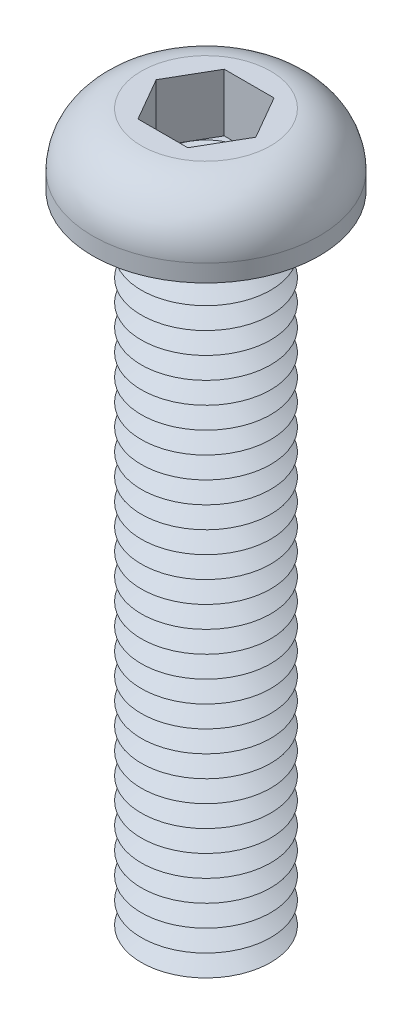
ISO-10303-21;
HEADER;
FILE_DESCRIPTION(('STEP AP214'),'2;1');
FILE_NAME('part.step','',(''),(''),'','','');
FILE_SCHEMA(('AUTOMOTIVE_DESIGN { 1 0 10303 214 1 1 1 1 }'));
ENDSEC;
DATA;
#1=APPLICATION_CONTEXT('core data for automotive mechanical design processes');
#2=APPLICATION_PROTOCOL_DEFINITION('international standard','automotive_design',2000,#1);
#3=PRODUCT_CONTEXT('',#1,'mechanical');
#4=PRODUCT('Part','Part','',(#3));
#5=PRODUCT_RELATED_PRODUCT_CATEGORY('part','',(#4));
#6=PRODUCT_DEFINITION_FORMATION('','',#4);
#7=PRODUCT_DEFINITION_CONTEXT('part definition',#1,'design');
#8=PRODUCT_DEFINITION('design','',#6,#7);
#9=PRODUCT_DEFINITION_SHAPE('','',#8);
#10=(LENGTH_UNIT() NAMED_UNIT(*) SI_UNIT(.MILLI.,.METRE.));
#11=(NAMED_UNIT(*) PLANE_ANGLE_UNIT() SI_UNIT($,.RADIAN.));
#12=(NAMED_UNIT(*) SI_UNIT($,.STERADIAN.) SOLID_ANGLE_UNIT());
#13=UNCERTAINTY_MEASURE_WITH_UNIT(LENGTH_MEASURE(1.E-05),#10,'distance_accuracy_value','');
#14=(GEOMETRIC_REPRESENTATION_CONTEXT(3) GLOBAL_UNCERTAINTY_ASSIGNED_CONTEXT((#13)) GLOBAL_UNIT_ASSIGNED_CONTEXT((#10,
#11,#12)) REPRESENTATION_CONTEXT('',''));
#15=CARTESIAN_POINT('',(0.,0.,0.));
#16=DIRECTION('',(0.,0.,1.));
#17=DIRECTION('',(1.,0.,0.));
#18=AXIS2_PLACEMENT_3D('',#15,#16,#17);
#19=CARTESIAN_POINT('',(0.,0.,0.));
#20=DIRECTION('',(0.,-1.,0.));
#21=DIRECTION('',(0.,0.,-1.));
#22=AXIS2_PLACEMENT_3D('',#19,#20,#21);
#23=TOROIDAL_SURFACE('',#22,3.5,0.5);
#24=CARTESIAN_POINT('',(0.,0.,-4.));
#25=VERTEX_POINT('',#24);
#26=VERTEX_LOOP('',#25);
#27=FACE_BOUND('',#26,.T.);
#28=ADVANCED_FACE('P0_F12',(#27),#23,.T.);
#29=CLOSED_SHELL('',(#28));
#30=MANIFOLD_SOLID_BREP('P0_B1',#29);
#31=CARTESIAN_POINT('',(1.15470053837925,0.62,-2.));
#32=DIRECTION('',(0.,1.,0.));
#33=DIRECTION('',(0.,0.,1.));
#34=AXIS2_PLACEMENT_3D('',#31,#32,#33);
#35=PLANE('',#34);
#36=CARTESIAN_POINT('',(0.,0.62,0.));
#37=DIRECTION('',(0.,1.,0.));
#38=DIRECTION('',(0.,0.,1.));
#39=AXIS2_PLACEMENT_3D('',#36,#37,#38);
#40=CIRCLE('',#39,2.);
#41=CARTESIAN_POINT('',(0.,0.62,2.));
#42=VERTEX_POINT('',#41);
#43=CARTESIAN_POINT('',(1.73205080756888,0.62,1.));
#44=VERTEX_POINT('',#43);
#45=EDGE_CURVE('P1_E93',#42,#44,#40,.T.);
#46=ORIENTED_EDGE('',*,*,#45,.F.);
#47=DIRECTION('',(1.,0.,0.));
#48=VECTOR('',#47,1.);
#49=CARTESIAN_POINT('',(-1.15470053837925,0.62,2.));
#50=LINE('',#49,#48);
#51=CARTESIAN_POINT('',(1.15470053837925,0.62,2.));
#52=VERTEX_POINT('',#51);
#53=EDGE_CURVE('P1_E116',#42,#52,#50,.T.);
#54=ORIENTED_EDGE('',*,*,#53,.T.);
#55=DIRECTION('',(0.5,0.,-0.866025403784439));
#56=VECTOR('',#55,1.);
#57=CARTESIAN_POINT('',(1.15470053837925,0.62,2.));
#58=LINE('',#57,#56);
#59=EDGE_CURVE('P1_E112',#52,#44,#58,.T.);
#60=ORIENTED_EDGE('',*,*,#59,.T.);
#61=EDGE_LOOP('',(#46,#54,#60));
#62=FACE_BOUND('',#61,.T.);
#63=ADVANCED_FACE('P1_F15',(#62),#35,.T.);
#64=CARTESIAN_POINT('',(0.,0.62,0.));
#65=DIRECTION('',(0.,1.,0.));
#66=DIRECTION('',(0.,0.,1.));
#67=AXIS2_PLACEMENT_3D('',#64,#65,#66);
#68=CIRCLE('',#67,2.);
#69=CARTESIAN_POINT('',(1.73205080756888,0.62,-1.));
#70=VERTEX_POINT('',#69);
#71=EDGE_CURVE('P1_E10',#44,#70,#68,.T.);
#72=ORIENTED_EDGE('',*,*,#71,.F.);
#73=CARTESIAN_POINT('',(2.3094010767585,0.62,0.));
#74=VERTEX_POINT('',#73);
#75=EDGE_CURVE('P1_E104',#44,#74,#58,.T.);
#76=ORIENTED_EDGE('',*,*,#75,.T.);
#77=DIRECTION('',(-0.5,0.,-0.866025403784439));
#78=VECTOR('',#77,1.);
#79=CARTESIAN_POINT('',(2.3094010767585,0.62,0.));
#80=LINE('',#79,#78);
#81=EDGE_CURVE('P1_E107',#74,#70,#80,.T.);
#82=ORIENTED_EDGE('',*,*,#81,.T.);
#83=EDGE_LOOP('',(#72,#76,#82));
#84=FACE_BOUND('',#83,.T.);
#85=ADVANCED_FACE('P1_F103',(#84),#35,.T.);
#86=CARTESIAN_POINT('',(0.,0.62,-2.));
#87=VERTEX_POINT('',#86);
#88=EDGE_CURVE('P1_E24',#70,#87,#68,.T.);
#89=ORIENTED_EDGE('',*,*,#88,.F.);
#90=CARTESIAN_POINT('',(1.15470053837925,0.62,-2.));
#91=VERTEX_POINT('',#90);
#92=EDGE_CURVE('P1_E139',#70,#91,#80,.T.);
#93=ORIENTED_EDGE('',*,*,#92,.T.);
#94=DIRECTION('',(-1.,0.,0.));
#95=VECTOR('',#94,1.);
#96=CARTESIAN_POINT('',(1.15470053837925,0.62,-2.));
#97=LINE('',#96,#95);
#98=EDGE_CURVE('P1_E396',#91,#87,#97,.T.);
#99=ORIENTED_EDGE('',*,*,#98,.T.);
#100=EDGE_LOOP('',(#89,#93,#99));
#101=FACE_BOUND('',#100,.T.);
#102=ADVANCED_FACE('P1_F361',(#101),#35,.T.);
#103=CARTESIAN_POINT('',(-1.73205080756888,0.62,-1.));
#104=VERTEX_POINT('',#103);
#105=EDGE_CURVE('P1_E391',#87,#104,#68,.T.);
#106=ORIENTED_EDGE('',*,*,#105,.F.);
#107=CARTESIAN_POINT('',(-1.15470053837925,0.62,-2.));
#108=VERTEX_POINT('',#107);
#109=EDGE_CURVE('P1_E400',#87,#108,#97,.T.);
#110=ORIENTED_EDGE('',*,*,#109,.T.);
#111=DIRECTION('',(-0.5,0.,0.866025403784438));
#112=VECTOR('',#111,1.);
#113=CARTESIAN_POINT('',(-1.15470053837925,0.62,-2.));
#114=LINE('',#113,#112);
#115=EDGE_CURVE('P1_E395',#108,#104,#114,.T.);
#116=ORIENTED_EDGE('',*,*,#115,.T.);
#117=EDGE_LOOP('',(#106,#110,#116));
#118=FACE_BOUND('',#117,.T.);
#119=ADVANCED_FACE('P1_F375',(#118),#35,.T.);
#120=CARTESIAN_POINT('',(-1.73205080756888,0.62,1.));
#121=VERTEX_POINT('',#120);
#122=EDGE_CURVE('P1_E31',#104,#121,#68,.T.);
#123=ORIENTED_EDGE('',*,*,#122,.F.);
#124=CARTESIAN_POINT('',(-2.3094010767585,0.62,0.));
#125=VERTEX_POINT('',#124);
#126=EDGE_CURVE('P1_E387',#104,#125,#114,.T.);
#127=ORIENTED_EDGE('',*,*,#126,.T.);
#128=DIRECTION('',(0.5,0.,0.866025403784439));
#129=VECTOR('',#128,1.);
#130=CARTESIAN_POINT('',(-2.3094010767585,0.62,0.));
#131=LINE('',#130,#129);
#132=EDGE_CURVE('P1_E390',#125,#121,#131,.T.);
#133=ORIENTED_EDGE('',*,*,#132,.T.);
#134=EDGE_LOOP('',(#123,#127,#133));
#135=FACE_BOUND('',#134,.T.);
#136=ADVANCED_FACE('P1_F366',(#135),#35,.T.);
#137=CARTESIAN_POINT('',(0.,-29.,0.));
#138=DIRECTION('',(0.,1.,0.));
#139=DIRECTION('',(0.,0.,1.));
#140=AXIS2_PLACEMENT_3D('',#137,#138,#139);
#141=CONICAL_SURFACE('',#140,2.13397459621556,1.0471975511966);
#142=CARTESIAN_POINT('',(0.,-28.5,0.));
#143=DIRECTION('',(0.,-1.,0.));
#144=DIRECTION('',(0.,0.,-1.));
#145=AXIS2_PLACEMENT_3D('',#142,#143,#144);
#146=CIRCLE('',#145,3.);
#147=CARTESIAN_POINT('',(0.,-28.5,-3.));
#148=VERTEX_POINT('',#147);
#149=EDGE_CURVE('P1_E323',#148,#148,#146,.T.);
#150=ORIENTED_EDGE('',*,*,#149,.T.);
#151=EDGE_LOOP('',(#150));
#152=FACE_BOUND('',#151,.T.);
#153=CARTESIAN_POINT('',(0.,-29.,0.));
#154=DIRECTION('',(0.,-1.,0.));
#155=DIRECTION('',(0.,0.,-1.));
#156=AXIS2_PLACEMENT_3D('',#153,#154,#155);
#157=CIRCLE('',#156,2.13397459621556);
#158=CARTESIAN_POINT('',(0.,-29.,-2.13397459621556));
#159=VERTEX_POINT('',#158);
#160=EDGE_CURVE('P1_E326',#159,#159,#157,.T.);
#161=ORIENTED_EDGE('',*,*,#160,.F.);
#162=EDGE_LOOP('',(#161));
#163=FACE_BOUND('',#162,.T.);
#164=ADVANCED_FACE('P1_F374',(#152,#163),#141,.T.);
#165=CARTESIAN_POINT('',(0.,-29.5,0.));
#166=DIRECTION('',(0.,-1.,0.));
#167=DIRECTION('',(0.,0.,-1.));
#168=AXIS2_PLACEMENT_3D('',#165,#166,#167);
#169=CONICAL_SURFACE('',#168,3.,1.0471975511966);
#170=ORIENTED_EDGE('',*,*,#160,.T.);
#171=EDGE_LOOP('',(#170));
#172=FACE_BOUND('',#171,.T.);
#173=CARTESIAN_POINT('',(0.,-29.5,0.));
#174=DIRECTION('',(0.,-1.,0.));
#175=DIRECTION('',(0.,0.,-1.));
#176=AXIS2_PLACEMENT_3D('',#173,#174,#175);
#177=CIRCLE('',#176,3.);
#178=CARTESIAN_POINT('',(0.,-29.5,-3.));
#179=VERTEX_POINT('',#178);
#180=EDGE_CURVE('P1_E329',#179,#179,#177,.T.);
#181=ORIENTED_EDGE('',*,*,#180,.F.);
#182=EDGE_LOOP('',(#181));
#183=FACE_BOUND('',#182,.T.);
#184=ADVANCED_FACE('P1_F381',(#172,#183),#169,.T.);
#185=CARTESIAN_POINT('',(0.,-30.,0.));
#186=DIRECTION('',(0.,1.,0.));
#187=DIRECTION('',(0.,0.,1.));
#188=AXIS2_PLACEMENT_3D('',#185,#186,#187);
#189=PLANE('',#188);
#190=CARTESIAN_POINT('',(0.,-30.,0.));
#191=DIRECTION('',(0.,-1.,0.));
#192=DIRECTION('',(0.,0.,-1.));
#193=AXIS2_PLACEMENT_3D('',#190,#191,#192);
#194=CIRCLE('',#193,2.13397459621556);
#195=CARTESIAN_POINT('',(0.,-30.,-2.13397459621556));
#196=VERTEX_POINT('',#195);
#197=EDGE_CURVE('P1_E332',#196,#196,#194,.T.);
#198=ORIENTED_EDGE('',*,*,#197,.T.);
#199=EDGE_LOOP('',(#198));
#200=FACE_BOUND('',#199,.T.);
#201=ADVANCED_FACE('P1_F459',(#200),#189,.F.);
#202=CARTESIAN_POINT('',(0.,-30.,0.));
#203=DIRECTION('',(0.,1.,0.));
#204=DIRECTION('',(0.,0.,1.));
#205=AXIS2_PLACEMENT_3D('',#202,#203,#204);
#206=CONICAL_SURFACE('',#205,2.13397459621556,1.0471975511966);
#207=ORIENTED_EDGE('',*,*,#180,.T.);
#208=EDGE_LOOP('',(#207));
#209=FACE_BOUND('',#208,.T.);
#210=ORIENTED_EDGE('',*,*,#197,.F.);
#211=EDGE_LOOP('',(#210));
#212=FACE_BOUND('',#211,.T.);
#213=ADVANCED_FACE('P1_F470',(#209,#212),#206,.T.);
#214=CARTESIAN_POINT('',(0.,-28.,0.));
#215=DIRECTION('',(0.,1.,0.));
#216=DIRECTION('',(0.,0.,1.));
#217=AXIS2_PLACEMENT_3D('',#214,#215,#216);
#218=CONICAL_SURFACE('',#217,2.13397459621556,1.0471975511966);
#219=CARTESIAN_POINT('',(0.,-27.5,0.));
#220=DIRECTION('',(0.,-1.,0.));
#221=DIRECTION('',(0.,0.,-1.));
#222=AXIS2_PLACEMENT_3D('',#219,#220,#221);
#223=CIRCLE('',#222,3.);
#224=CARTESIAN_POINT('',(0.,-27.5,-3.));
#225=VERTEX_POINT('',#224);
#226=EDGE_CURVE('P1_E317',#225,#225,#223,.T.);
#227=ORIENTED_EDGE('',*,*,#226,.T.);
#228=EDGE_LOOP('',(#227));
#229=FACE_BOUND('',#228,.T.);
#230=CARTESIAN_POINT('',(0.,-28.,0.));
#231=DIRECTION('',(0.,-1.,0.));
#232=DIRECTION('',(0.,0.,-1.));
#233=AXIS2_PLACEMENT_3D('',#230,#231,#232);
#234=CIRCLE('',#233,2.13397459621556);
#235=CARTESIAN_POINT('',(0.,-28.,-2.13397459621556));
#236=VERTEX_POINT('',#235);
#237=EDGE_CURVE('P1_E320',#236,#236,#234,.T.);
#238=ORIENTED_EDGE('',*,*,#237,.F.);
#239=EDGE_LOOP('',(#238));
#240=FACE_BOUND('',#239,.T.);
#241=ADVANCED_FACE('P1_F479',(#229,#240),#218,.T.);
#242=CARTESIAN_POINT('',(0.,-28.5,0.));
#243=DIRECTION('',(0.,-1.,0.));
#244=DIRECTION('',(0.,0.,-1.));
#245=AXIS2_PLACEMENT_3D('',#242,#243,#244);
#246=CONICAL_SURFACE('',#245,3.,1.0471975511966);
#247=ORIENTED_EDGE('',*,*,#237,.T.);
#248=EDGE_LOOP('',(#247));
#249=FACE_BOUND('',#248,.T.);
#250=ORIENTED_EDGE('',*,*,#149,.F.);
#251=EDGE_LOOP('',(#250));
#252=FACE_BOUND('',#251,.T.);
#253=ADVANCED_FACE('P1_F488',(#249,#252),#246,.T.);
#254=CARTESIAN_POINT('',(0.,-27.,0.));
#255=DIRECTION('',(0.,1.,0.));
#256=DIRECTION('',(0.,0.,1.));
#257=AXIS2_PLACEMENT_3D('',#254,#255,#256);
#258=CONICAL_SURFACE('',#257,2.13397459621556,1.0471975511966);
#259=CARTESIAN_POINT('',(0.,-26.5,0.));
#260=DIRECTION('',(0.,-1.,0.));
#261=DIRECTION('',(0.,0.,-1.));
#262=AXIS2_PLACEMENT_3D('',#259,#260,#261);
#263=CIRCLE('',#262,3.);
#264=CARTESIAN_POINT('',(0.,-26.5,-3.));
#265=VERTEX_POINT('',#264);
#266=EDGE_CURVE('P1_E311',#265,#265,#263,.T.);
#267=ORIENTED_EDGE('',*,*,#266,.T.);
#268=EDGE_LOOP('',(#267));
#269=FACE_BOUND('',#268,.T.);
#270=CARTESIAN_POINT('',(0.,-27.,0.));
#271=DIRECTION('',(0.,-1.,0.));
#272=DIRECTION('',(0.,0.,-1.));
#273=AXIS2_PLACEMENT_3D('',#270,#271,#272);
#274=CIRCLE('',#273,2.13397459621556);
#275=CARTESIAN_POINT('',(0.,-27.,-2.13397459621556));
#276=VERTEX_POINT('',#275);
#277=EDGE_CURVE('P1_E314',#276,#276,#274,.T.);
#278=ORIENTED_EDGE('',*,*,#277,.F.);
#279=EDGE_LOOP('',(#278));
#280=FACE_BOUND('',#279,.T.);
#281=ADVANCED_FACE('P1_F498',(#269,#280),#258,.T.);
#282=CARTESIAN_POINT('',(0.,-27.5,0.));
#283=DIRECTION('',(0.,-1.,0.));
#284=DIRECTION('',(0.,0.,-1.));
#285=AXIS2_PLACEMENT_3D('',#282,#283,#284);
#286=CONICAL_SURFACE('',#285,3.,1.0471975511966);
#287=ORIENTED_EDGE('',*,*,#277,.T.);
#288=EDGE_LOOP('',(#287));
#289=FACE_BOUND('',#288,.T.);
#290=ORIENTED_EDGE('',*,*,#226,.F.);
#291=EDGE_LOOP('',(#290));
#292=FACE_BOUND('',#291,.T.);
#293=ADVANCED_FACE('P1_F508',(#289,#292),#286,.T.);
#294=CARTESIAN_POINT('',(0.,-26.,0.));
#295=DIRECTION('',(0.,1.,0.));
#296=DIRECTION('',(0.,0.,1.));
#297=AXIS2_PLACEMENT_3D('',#294,#295,#296);
#298=CONICAL_SURFACE('',#297,2.13397459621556,1.0471975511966);
#299=CARTESIAN_POINT('',(0.,-25.5,0.));
#300=DIRECTION('',(0.,-1.,0.));
#301=DIRECTION('',(0.,0.,-1.));
#302=AXIS2_PLACEMENT_3D('',#299,#300,#301);
#303=CIRCLE('',#302,3.);
#304=CARTESIAN_POINT('',(0.,-25.5,-3.));
#305=VERTEX_POINT('',#304);
#306=EDGE_CURVE('P1_E305',#305,#305,#303,.T.);
#307=ORIENTED_EDGE('',*,*,#306,.T.);
#308=EDGE_LOOP('',(#307));
#309=FACE_BOUND('',#308,.T.);
#310=CARTESIAN_POINT('',(0.,-26.,0.));
#311=DIRECTION('',(0.,-1.,0.));
#312=DIRECTION('',(0.,0.,-1.));
#313=AXIS2_PLACEMENT_3D('',#310,#311,#312);
#314=CIRCLE('',#313,2.13397459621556);
#315=CARTESIAN_POINT('',(0.,-26.,-2.13397459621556));
#316=VERTEX_POINT('',#315);
#317=EDGE_CURVE('P1_E308',#316,#316,#314,.T.);
#318=ORIENTED_EDGE('',*,*,#317,.F.);
#319=EDGE_LOOP('',(#318));
#320=FACE_BOUND('',#319,.T.);
#321=ADVANCED_FACE('P1_F518',(#309,#320),#298,.T.);
#322=CARTESIAN_POINT('',(0.,-26.5,0.));
#323=DIRECTION('',(0.,-1.,0.));
#324=DIRECTION('',(0.,0.,-1.));
#325=AXIS2_PLACEMENT_3D('',#322,#323,#324);
#326=CONICAL_SURFACE('',#325,3.,1.0471975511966);
#327=ORIENTED_EDGE('',*,*,#317,.T.);
#328=EDGE_LOOP('',(#327));
#329=FACE_BOUND('',#328,.T.);
#330=ORIENTED_EDGE('',*,*,#266,.F.);
#331=EDGE_LOOP('',(#330));
#332=FACE_BOUND('',#331,.T.);
#333=ADVANCED_FACE('P1_F528',(#329,#332),#326,.T.);
#334=CARTESIAN_POINT('',(0.,-25.,0.));
#335=DIRECTION('',(0.,1.,0.));
#336=DIRECTION('',(0.,0.,1.));
#337=AXIS2_PLACEMENT_3D('',#334,#335,#336);
#338=CONICAL_SURFACE('',#337,2.13397459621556,1.0471975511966);
#339=CARTESIAN_POINT('',(0.,-24.5,0.));
#340=DIRECTION('',(0.,-1.,0.));
#341=DIRECTION('',(0.,0.,-1.));
#342=AXIS2_PLACEMENT_3D('',#339,#340,#341);
#343=CIRCLE('',#342,3.);
#344=CARTESIAN_POINT('',(0.,-24.5,-3.));
#345=VERTEX_POINT('',#344);
#346=EDGE_CURVE('P1_E299',#345,#345,#343,.T.);
#347=ORIENTED_EDGE('',*,*,#346,.T.);
#348=EDGE_LOOP('',(#347));
#349=FACE_BOUND('',#348,.T.);
#350=CARTESIAN_POINT('',(0.,-25.,0.));
#351=DIRECTION('',(0.,-1.,0.));
#352=DIRECTION('',(0.,0.,-1.));
#353=AXIS2_PLACEMENT_3D('',#350,#351,#352);
#354=CIRCLE('',#353,2.13397459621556);
#355=CARTESIAN_POINT('',(0.,-25.,-2.13397459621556));
#356=VERTEX_POINT('',#355);
#357=EDGE_CURVE('P1_E302',#356,#356,#354,.T.);
#358=ORIENTED_EDGE('',*,*,#357,.F.);
#359=EDGE_LOOP('',(#358));
#360=FACE_BOUND('',#359,.T.);
#361=ADVANCED_FACE('P1_F538',(#349,#360),#338,.T.);
#362=CARTESIAN_POINT('',(0.,-25.5,0.));
#363=DIRECTION('',(0.,-1.,0.));
#364=DIRECTION('',(0.,0.,-1.));
#365=AXIS2_PLACEMENT_3D('',#362,#363,#364);
#366=CONICAL_SURFACE('',#365,3.,1.0471975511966);
#367=ORIENTED_EDGE('',*,*,#357,.T.);
#368=EDGE_LOOP('',(#367));
#369=FACE_BOUND('',#368,.T.);
#370=ORIENTED_EDGE('',*,*,#306,.F.);
#371=EDGE_LOOP('',(#370));
#372=FACE_BOUND('',#371,.T.);
#373=ADVANCED_FACE('P1_F548',(#369,#372),#366,.T.);
#374=CARTESIAN_POINT('',(0.,-24.,0.));
#375=DIRECTION('',(0.,1.,0.));
#376=DIRECTION('',(0.,0.,1.));
#377=AXIS2_PLACEMENT_3D('',#374,#375,#376);
#378=CONICAL_SURFACE('',#377,2.13397459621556,1.0471975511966);
#379=CARTESIAN_POINT('',(0.,-23.5,0.));
#380=DIRECTION('',(0.,-1.,0.));
#381=DIRECTION('',(0.,0.,-1.));
#382=AXIS2_PLACEMENT_3D('',#379,#380,#381);
#383=CIRCLE('',#382,3.);
#384=CARTESIAN_POINT('',(0.,-23.5,-3.));
#385=VERTEX_POINT('',#384);
#386=EDGE_CURVE('P1_E293',#385,#385,#383,.T.);
#387=ORIENTED_EDGE('',*,*,#386,.T.);
#388=EDGE_LOOP('',(#387));
#389=FACE_BOUND('',#388,.T.);
#390=CARTESIAN_POINT('',(0.,-24.,0.));
#391=DIRECTION('',(0.,-1.,0.));
#392=DIRECTION('',(0.,0.,-1.));
#393=AXIS2_PLACEMENT_3D('',#390,#391,#392);
#394=CIRCLE('',#393,2.13397459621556);
#395=CARTESIAN_POINT('',(0.,-24.,-2.13397459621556));
#396=VERTEX_POINT('',#395);
#397=EDGE_CURVE('P1_E296',#396,#396,#394,.T.);
#398=ORIENTED_EDGE('',*,*,#397,.F.);
#399=EDGE_LOOP('',(#398));
#400=FACE_BOUND('',#399,.T.);
#401=ADVANCED_FACE('P1_F558',(#389,#400),#378,.T.);
#402=CARTESIAN_POINT('',(0.,-24.5,0.));
#403=DIRECTION('',(0.,-1.,0.));
#404=DIRECTION('',(0.,0.,-1.));
#405=AXIS2_PLACEMENT_3D('',#402,#403,#404);
#406=CONICAL_SURFACE('',#405,3.,1.0471975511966);
#407=ORIENTED_EDGE('',*,*,#397,.T.);
#408=EDGE_LOOP('',(#407));
#409=FACE_BOUND('',#408,.T.);
#410=ORIENTED_EDGE('',*,*,#346,.F.);
#411=EDGE_LOOP('',(#410));
#412=FACE_BOUND('',#411,.T.);
#413=ADVANCED_FACE('P1_F568',(#409,#412),#406,.T.);
#414=CARTESIAN_POINT('',(0.,-23.,0.));
#415=DIRECTION('',(0.,1.,0.));
#416=DIRECTION('',(0.,0.,1.));
#417=AXIS2_PLACEMENT_3D('',#414,#415,#416);
#418=CONICAL_SURFACE('',#417,2.13397459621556,1.0471975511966);
#419=CARTESIAN_POINT('',(0.,-22.5,0.));
#420=DIRECTION('',(0.,-1.,0.));
#421=DIRECTION('',(0.,0.,-1.));
#422=AXIS2_PLACEMENT_3D('',#419,#420,#421);
#423=CIRCLE('',#422,3.);
#424=CARTESIAN_POINT('',(0.,-22.5,-3.));
#425=VERTEX_POINT('',#424);
#426=EDGE_CURVE('P1_E287',#425,#425,#423,.T.);
#427=ORIENTED_EDGE('',*,*,#426,.T.);
#428=EDGE_LOOP('',(#427));
#429=FACE_BOUND('',#428,.T.);
#430=CARTESIAN_POINT('',(0.,-23.,0.));
#431=DIRECTION('',(0.,-1.,0.));
#432=DIRECTION('',(0.,0.,-1.));
#433=AXIS2_PLACEMENT_3D('',#430,#431,#432);
#434=CIRCLE('',#433,2.13397459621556);
#435=CARTESIAN_POINT('',(0.,-23.,-2.13397459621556));
#436=VERTEX_POINT('',#435);
#437=EDGE_CURVE('P1_E290',#436,#436,#434,.T.);
#438=ORIENTED_EDGE('',*,*,#437,.F.);
#439=EDGE_LOOP('',(#438));
#440=FACE_BOUND('',#439,.T.);
#441=ADVANCED_FACE('P1_F578',(#429,#440),#418,.T.);
#442=CARTESIAN_POINT('',(0.,-23.5,0.));
#443=DIRECTION('',(0.,-1.,0.));
#444=DIRECTION('',(0.,0.,-1.));
#445=AXIS2_PLACEMENT_3D('',#442,#443,#444);
#446=CONICAL_SURFACE('',#445,3.,1.0471975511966);
#447=ORIENTED_EDGE('',*,*,#437,.T.);
#448=EDGE_LOOP('',(#447));
#449=FACE_BOUND('',#448,.T.);
#450=ORIENTED_EDGE('',*,*,#386,.F.);
#451=EDGE_LOOP('',(#450));
#452=FACE_BOUND('',#451,.T.);
#453=ADVANCED_FACE('P1_F588',(#449,#452),#446,.T.);
#454=CARTESIAN_POINT('',(0.,-22.,0.));
#455=DIRECTION('',(0.,1.,0.));
#456=DIRECTION('',(0.,0.,1.));
#457=AXIS2_PLACEMENT_3D('',#454,#455,#456);
#458=CONICAL_SURFACE('',#457,2.13397459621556,1.0471975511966);
#459=CARTESIAN_POINT('',(0.,-21.5,0.));
#460=DIRECTION('',(0.,-1.,0.));
#461=DIRECTION('',(0.,0.,-1.));
#462=AXIS2_PLACEMENT_3D('',#459,#460,#461);
#463=CIRCLE('',#462,3.);
#464=CARTESIAN_POINT('',(0.,-21.5,-3.));
#465=VERTEX_POINT('',#464);
#466=EDGE_CURVE('P1_E281',#465,#465,#463,.T.);
#467=ORIENTED_EDGE('',*,*,#466,.T.);
#468=EDGE_LOOP('',(#467));
#469=FACE_BOUND('',#468,.T.);
#470=CARTESIAN_POINT('',(0.,-22.,0.));
#471=DIRECTION('',(0.,-1.,0.));
#472=DIRECTION('',(0.,0.,-1.));
#473=AXIS2_PLACEMENT_3D('',#470,#471,#472);
#474=CIRCLE('',#473,2.13397459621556);
#475=CARTESIAN_POINT('',(0.,-22.,-2.13397459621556));
#476=VERTEX_POINT('',#475);
#477=EDGE_CURVE('P1_E284',#476,#476,#474,.T.);
#478=ORIENTED_EDGE('',*,*,#477,.F.);
#479=EDGE_LOOP('',(#478));
#480=FACE_BOUND('',#479,.T.);
#481=ADVANCED_FACE('P1_F598',(#469,#480),#458,.T.);
#482=CARTESIAN_POINT('',(0.,-22.5,0.));
#483=DIRECTION('',(0.,-1.,0.));
#484=DIRECTION('',(0.,0.,-1.));
#485=AXIS2_PLACEMENT_3D('',#482,#483,#484);
#486=CONICAL_SURFACE('',#485,3.,1.0471975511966);
#487=ORIENTED_EDGE('',*,*,#477,.T.);
#488=EDGE_LOOP('',(#487));
#489=FACE_BOUND('',#488,.T.);
#490=ORIENTED_EDGE('',*,*,#426,.F.);
#491=EDGE_LOOP('',(#490));
#492=FACE_BOUND('',#491,.T.);
#493=ADVANCED_FACE('P1_F608',(#489,#492),#486,.T.);
#494=CARTESIAN_POINT('',(0.,-21.,0.));
#495=DIRECTION('',(0.,1.,0.));
#496=DIRECTION('',(0.,0.,1.));
#497=AXIS2_PLACEMENT_3D('',#494,#495,#496);
#498=CONICAL_SURFACE('',#497,2.13397459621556,1.0471975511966);
#499=CARTESIAN_POINT('',(0.,-20.5,0.));
#500=DIRECTION('',(0.,-1.,0.));
#501=DIRECTION('',(0.,0.,-1.));
#502=AXIS2_PLACEMENT_3D('',#499,#500,#501);
#503=CIRCLE('',#502,3.);
#504=CARTESIAN_POINT('',(0.,-20.5,-3.));
#505=VERTEX_POINT('',#504);
#506=EDGE_CURVE('P1_E275',#505,#505,#503,.T.);
#507=ORIENTED_EDGE('',*,*,#506,.T.);
#508=EDGE_LOOP('',(#507));
#509=FACE_BOUND('',#508,.T.);
#510=CARTESIAN_POINT('',(0.,-21.,0.));
#511=DIRECTION('',(0.,-1.,0.));
#512=DIRECTION('',(0.,0.,-1.));
#513=AXIS2_PLACEMENT_3D('',#510,#511,#512);
#514=CIRCLE('',#513,2.13397459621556);
#515=CARTESIAN_POINT('',(0.,-21.,-2.13397459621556));
#516=VERTEX_POINT('',#515);
#517=EDGE_CURVE('P1_E278',#516,#516,#514,.T.);
#518=ORIENTED_EDGE('',*,*,#517,.F.);
#519=EDGE_LOOP('',(#518));
#520=FACE_BOUND('',#519,.T.);
#521=ADVANCED_FACE('P1_F618',(#509,#520),#498,.T.);
#522=CARTESIAN_POINT('',(0.,-21.5,0.));
#523=DIRECTION('',(0.,-1.,0.));
#524=DIRECTION('',(0.,0.,-1.));
#525=AXIS2_PLACEMENT_3D('',#522,#523,#524);
#526=CONICAL_SURFACE('',#525,3.,1.0471975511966);
#527=ORIENTED_EDGE('',*,*,#517,.T.);
#528=EDGE_LOOP('',(#527));
#529=FACE_BOUND('',#528,.T.);
#530=ORIENTED_EDGE('',*,*,#466,.F.);
#531=EDGE_LOOP('',(#530));
#532=FACE_BOUND('',#531,.T.);
#533=ADVANCED_FACE('P1_F628',(#529,#532),#526,.T.);
#534=CARTESIAN_POINT('',(0.,-20.,0.));
#535=DIRECTION('',(0.,1.,0.));
#536=DIRECTION('',(0.,0.,1.));
#537=AXIS2_PLACEMENT_3D('',#534,#535,#536);
#538=CONICAL_SURFACE('',#537,2.13397459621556,1.0471975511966);
#539=CARTESIAN_POINT('',(0.,-19.5,0.));
#540=DIRECTION('',(0.,-1.,0.));
#541=DIRECTION('',(0.,0.,-1.));
#542=AXIS2_PLACEMENT_3D('',#539,#540,#541);
#543=CIRCLE('',#542,3.);
#544=CARTESIAN_POINT('',(0.,-19.5,-3.));
#545=VERTEX_POINT('',#544);
#546=EDGE_CURVE('P1_E269',#545,#545,#543,.T.);
#547=ORIENTED_EDGE('',*,*,#546,.T.);
#548=EDGE_LOOP('',(#547));
#549=FACE_BOUND('',#548,.T.);
#550=CARTESIAN_POINT('',(0.,-20.,0.));
#551=DIRECTION('',(0.,-1.,0.));
#552=DIRECTION('',(0.,0.,-1.));
#553=AXIS2_PLACEMENT_3D('',#550,#551,#552);
#554=CIRCLE('',#553,2.13397459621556);
#555=CARTESIAN_POINT('',(0.,-20.,-2.13397459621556));
#556=VERTEX_POINT('',#555);
#557=EDGE_CURVE('P1_E272',#556,#556,#554,.T.);
#558=ORIENTED_EDGE('',*,*,#557,.F.);
#559=EDGE_LOOP('',(#558));
#560=FACE_BOUND('',#559,.T.);
#561=ADVANCED_FACE('P1_F638',(#549,#560),#538,.T.);
#562=CARTESIAN_POINT('',(0.,-20.5,0.));
#563=DIRECTION('',(0.,-1.,0.));
#564=DIRECTION('',(0.,0.,-1.));
#565=AXIS2_PLACEMENT_3D('',#562,#563,#564);
#566=CONICAL_SURFACE('',#565,3.,1.0471975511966);
#567=ORIENTED_EDGE('',*,*,#557,.T.);
#568=EDGE_LOOP('',(#567));
#569=FACE_BOUND('',#568,.T.);
#570=ORIENTED_EDGE('',*,*,#506,.F.);
#571=EDGE_LOOP('',(#570));
#572=FACE_BOUND('',#571,.T.);
#573=ADVANCED_FACE('P1_F648',(#569,#572),#566,.T.);
#574=CARTESIAN_POINT('',(0.,-19.,0.));
#575=DIRECTION('',(0.,1.,0.));
#576=DIRECTION('',(0.,0.,1.));
#577=AXIS2_PLACEMENT_3D('',#574,#575,#576);
#578=CONICAL_SURFACE('',#577,2.13397459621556,1.0471975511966);
#579=CARTESIAN_POINT('',(0.,-18.5,0.));
#580=DIRECTION('',(0.,-1.,0.));
#581=DIRECTION('',(0.,0.,-1.));
#582=AXIS2_PLACEMENT_3D('',#579,#580,#581);
#583=CIRCLE('',#582,3.);
#584=CARTESIAN_POINT('',(0.,-18.5,-3.));
#585=VERTEX_POINT('',#584);
#586=EDGE_CURVE('P1_E263',#585,#585,#583,.T.);
#587=ORIENTED_EDGE('',*,*,#586,.T.);
#588=EDGE_LOOP('',(#587));
#589=FACE_BOUND('',#588,.T.);
#590=CARTESIAN_POINT('',(0.,-19.,0.));
#591=DIRECTION('',(0.,-1.,0.));
#592=DIRECTION('',(0.,0.,-1.));
#593=AXIS2_PLACEMENT_3D('',#590,#591,#592);
#594=CIRCLE('',#593,2.13397459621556);
#595=CARTESIAN_POINT('',(0.,-19.,-2.13397459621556));
#596=VERTEX_POINT('',#595);
#597=EDGE_CURVE('P1_E266',#596,#596,#594,.T.);
#598=ORIENTED_EDGE('',*,*,#597,.F.);
#599=EDGE_LOOP('',(#598));
#600=FACE_BOUND('',#599,.T.);
#601=ADVANCED_FACE('P1_F658',(#589,#600),#578,.T.);
#602=CARTESIAN_POINT('',(0.,-19.5,0.));
#603=DIRECTION('',(0.,-1.,0.));
#604=DIRECTION('',(0.,0.,-1.));
#605=AXIS2_PLACEMENT_3D('',#602,#603,#604);
#606=CONICAL_SURFACE('',#605,3.,1.0471975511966);
#607=ORIENTED_EDGE('',*,*,#597,.T.);
#608=EDGE_LOOP('',(#607));
#609=FACE_BOUND('',#608,.T.);
#610=ORIENTED_EDGE('',*,*,#546,.F.);
#611=EDGE_LOOP('',(#610));
#612=FACE_BOUND('',#611,.T.);
#613=ADVANCED_FACE('P1_F668',(#609,#612),#606,.T.);
#614=CARTESIAN_POINT('',(0.,-18.,0.));
#615=DIRECTION('',(0.,1.,0.));
#616=DIRECTION('',(0.,0.,1.));
#617=AXIS2_PLACEMENT_3D('',#614,#615,#616);
#618=CONICAL_SURFACE('',#617,2.13397459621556,1.0471975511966);
#619=CARTESIAN_POINT('',(0.,-17.5,0.));
#620=DIRECTION('',(0.,-1.,0.));
#621=DIRECTION('',(0.,0.,-1.));
#622=AXIS2_PLACEMENT_3D('',#619,#620,#621);
#623=CIRCLE('',#622,3.);
#624=CARTESIAN_POINT('',(0.,-17.5,-3.));
#625=VERTEX_POINT('',#624);
#626=EDGE_CURVE('P1_E257',#625,#625,#623,.T.);
#627=ORIENTED_EDGE('',*,*,#626,.T.);
#628=EDGE_LOOP('',(#627));
#629=FACE_BOUND('',#628,.T.);
#630=CARTESIAN_POINT('',(0.,-18.,0.));
#631=DIRECTION('',(0.,-1.,0.));
#632=DIRECTION('',(0.,0.,-1.));
#633=AXIS2_PLACEMENT_3D('',#630,#631,#632);
#634=CIRCLE('',#633,2.13397459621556);
#635=CARTESIAN_POINT('',(0.,-18.,-2.13397459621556));
#636=VERTEX_POINT('',#635);
#637=EDGE_CURVE('P1_E260',#636,#636,#634,.T.);
#638=ORIENTED_EDGE('',*,*,#637,.F.);
#639=EDGE_LOOP('',(#638));
#640=FACE_BOUND('',#639,.T.);
#641=ADVANCED_FACE('P1_F678',(#629,#640),#618,.T.);
#642=CARTESIAN_POINT('',(0.,-18.5,0.));
#643=DIRECTION('',(0.,-1.,0.));
#644=DIRECTION('',(0.,0.,-1.));
#645=AXIS2_PLACEMENT_3D('',#642,#643,#644);
#646=CONICAL_SURFACE('',#645,3.,1.0471975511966);
#647=ORIENTED_EDGE('',*,*,#637,.T.);
#648=EDGE_LOOP('',(#647));
#649=FACE_BOUND('',#648,.T.);
#650=ORIENTED_EDGE('',*,*,#586,.F.);
#651=EDGE_LOOP('',(#650));
#652=FACE_BOUND('',#651,.T.);
#653=ADVANCED_FACE('P1_F688',(#649,#652),#646,.T.);
#654=CARTESIAN_POINT('',(0.,-17.,0.));
#655=DIRECTION('',(0.,1.,0.));
#656=DIRECTION('',(0.,0.,1.));
#657=AXIS2_PLACEMENT_3D('',#654,#655,#656);
#658=CONICAL_SURFACE('',#657,2.13397459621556,1.0471975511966);
#659=CARTESIAN_POINT('',(0.,-16.5,0.));
#660=DIRECTION('',(0.,-1.,0.));
#661=DIRECTION('',(0.,0.,-1.));
#662=AXIS2_PLACEMENT_3D('',#659,#660,#661);
#663=CIRCLE('',#662,3.);
#664=CARTESIAN_POINT('',(0.,-16.5,-3.));
#665=VERTEX_POINT('',#664);
#666=EDGE_CURVE('P1_E251',#665,#665,#663,.T.);
#667=ORIENTED_EDGE('',*,*,#666,.T.);
#668=EDGE_LOOP('',(#667));
#669=FACE_BOUND('',#668,.T.);
#670=CARTESIAN_POINT('',(0.,-17.,0.));
#671=DIRECTION('',(0.,-1.,0.));
#672=DIRECTION('',(0.,0.,-1.));
#673=AXIS2_PLACEMENT_3D('',#670,#671,#672);
#674=CIRCLE('',#673,2.13397459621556);
#675=CARTESIAN_POINT('',(0.,-17.,-2.13397459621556));
#676=VERTEX_POINT('',#675);
#677=EDGE_CURVE('P1_E254',#676,#676,#674,.T.);
#678=ORIENTED_EDGE('',*,*,#677,.F.);
#679=EDGE_LOOP('',(#678));
#680=FACE_BOUND('',#679,.T.);
#681=ADVANCED_FACE('P1_F698',(#669,#680),#658,.T.);
#682=CARTESIAN_POINT('',(0.,-17.5,0.));
#683=DIRECTION('',(0.,-1.,0.));
#684=DIRECTION('',(0.,0.,-1.));
#685=AXIS2_PLACEMENT_3D('',#682,#683,#684);
#686=CONICAL_SURFACE('',#685,3.,1.0471975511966);
#687=ORIENTED_EDGE('',*,*,#677,.T.);
#688=EDGE_LOOP('',(#687));
#689=FACE_BOUND('',#688,.T.);
#690=ORIENTED_EDGE('',*,*,#626,.F.);
#691=EDGE_LOOP('',(#690));
#692=FACE_BOUND('',#691,.T.);
#693=ADVANCED_FACE('P1_F708',(#689,#692),#686,.T.);
#694=CARTESIAN_POINT('',(0.,-16.,0.));
#695=DIRECTION('',(0.,1.,0.));
#696=DIRECTION('',(0.,0.,1.));
#697=AXIS2_PLACEMENT_3D('',#694,#695,#696);
#698=CONICAL_SURFACE('',#697,2.13397459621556,1.0471975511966);
#699=CARTESIAN_POINT('',(0.,-15.5,0.));
#700=DIRECTION('',(0.,-1.,0.));
#701=DIRECTION('',(0.,0.,-1.));
#702=AXIS2_PLACEMENT_3D('',#699,#700,#701);
#703=CIRCLE('',#702,3.);
#704=CARTESIAN_POINT('',(0.,-15.5,-3.));
#705=VERTEX_POINT('',#704);
#706=EDGE_CURVE('P1_E245',#705,#705,#703,.T.);
#707=ORIENTED_EDGE('',*,*,#706,.T.);
#708=EDGE_LOOP('',(#707));
#709=FACE_BOUND('',#708,.T.);
#710=CARTESIAN_POINT('',(0.,-16.,0.));
#711=DIRECTION('',(0.,-1.,0.));
#712=DIRECTION('',(0.,0.,-1.));
#713=AXIS2_PLACEMENT_3D('',#710,#711,#712);
#714=CIRCLE('',#713,2.13397459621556);
#715=CARTESIAN_POINT('',(0.,-16.,-2.13397459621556));
#716=VERTEX_POINT('',#715);
#717=EDGE_CURVE('P1_E248',#716,#716,#714,.T.);
#718=ORIENTED_EDGE('',*,*,#717,.F.);
#719=EDGE_LOOP('',(#718));
#720=FACE_BOUND('',#719,.T.);
#721=ADVANCED_FACE('P1_F718',(#709,#720),#698,.T.);
#722=CARTESIAN_POINT('',(0.,-16.5,0.));
#723=DIRECTION('',(0.,-1.,0.));
#724=DIRECTION('',(0.,0.,-1.));
#725=AXIS2_PLACEMENT_3D('',#722,#723,#724);
#726=CONICAL_SURFACE('',#725,3.,1.0471975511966);
#727=ORIENTED_EDGE('',*,*,#717,.T.);
#728=EDGE_LOOP('',(#727));
#729=FACE_BOUND('',#728,.T.);
#730=ORIENTED_EDGE('',*,*,#666,.F.);
#731=EDGE_LOOP('',(#730));
#732=FACE_BOUND('',#731,.T.);
#733=ADVANCED_FACE('P1_F728',(#729,#732),#726,.T.);
#734=CARTESIAN_POINT('',(0.,-15.,0.));
#735=DIRECTION('',(0.,1.,0.));
#736=DIRECTION('',(0.,0.,1.));
#737=AXIS2_PLACEMENT_3D('',#734,#735,#736);
#738=CONICAL_SURFACE('',#737,2.13397459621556,1.0471975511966);
#739=CARTESIAN_POINT('',(0.,-14.5,0.));
#740=DIRECTION('',(0.,-1.,0.));
#741=DIRECTION('',(0.,0.,-1.));
#742=AXIS2_PLACEMENT_3D('',#739,#740,#741);
#743=CIRCLE('',#742,3.);
#744=CARTESIAN_POINT('',(0.,-14.5,-3.));
#745=VERTEX_POINT('',#744);
#746=EDGE_CURVE('P1_E239',#745,#745,#743,.T.);
#747=ORIENTED_EDGE('',*,*,#746,.T.);
#748=EDGE_LOOP('',(#747));
#749=FACE_BOUND('',#748,.T.);
#750=CARTESIAN_POINT('',(0.,-15.,0.));
#751=DIRECTION('',(0.,-1.,0.));
#752=DIRECTION('',(0.,0.,-1.));
#753=AXIS2_PLACEMENT_3D('',#750,#751,#752);
#754=CIRCLE('',#753,2.13397459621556);
#755=CARTESIAN_POINT('',(0.,-15.,-2.13397459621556));
#756=VERTEX_POINT('',#755);
#757=EDGE_CURVE('P1_E242',#756,#756,#754,.T.);
#758=ORIENTED_EDGE('',*,*,#757,.F.);
#759=EDGE_LOOP('',(#758));
#760=FACE_BOUND('',#759,.T.);
#761=ADVANCED_FACE('P1_F738',(#749,#760),#738,.T.);
#762=CARTESIAN_POINT('',(0.,-15.5,0.));
#763=DIRECTION('',(0.,-1.,0.));
#764=DIRECTION('',(0.,0.,-1.));
#765=AXIS2_PLACEMENT_3D('',#762,#763,#764);
#766=CONICAL_SURFACE('',#765,3.,1.0471975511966);
#767=ORIENTED_EDGE('',*,*,#757,.T.);
#768=EDGE_LOOP('',(#767));
#769=FACE_BOUND('',#768,.T.);
#770=ORIENTED_EDGE('',*,*,#706,.F.);
#771=EDGE_LOOP('',(#770));
#772=FACE_BOUND('',#771,.T.);
#773=ADVANCED_FACE('P1_F748',(#769,#772),#766,.T.);
#774=CARTESIAN_POINT('',(0.,-14.,0.));
#775=DIRECTION('',(0.,1.,0.));
#776=DIRECTION('',(0.,0.,1.));
#777=AXIS2_PLACEMENT_3D('',#774,#775,#776);
#778=CONICAL_SURFACE('',#777,2.13397459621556,1.0471975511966);
#779=CARTESIAN_POINT('',(0.,-13.5,0.));
#780=DIRECTION('',(0.,-1.,0.));
#781=DIRECTION('',(0.,0.,-1.));
#782=AXIS2_PLACEMENT_3D('',#779,#780,#781);
#783=CIRCLE('',#782,3.);
#784=CARTESIAN_POINT('',(0.,-13.5,-3.));
#785=VERTEX_POINT('',#784);
#786=EDGE_CURVE('P1_E233',#785,#785,#783,.T.);
#787=ORIENTED_EDGE('',*,*,#786,.T.);
#788=EDGE_LOOP('',(#787));
#789=FACE_BOUND('',#788,.T.);
#790=CARTESIAN_POINT('',(0.,-14.,0.));
#791=DIRECTION('',(0.,-1.,0.));
#792=DIRECTION('',(0.,0.,-1.));
#793=AXIS2_PLACEMENT_3D('',#790,#791,#792);
#794=CIRCLE('',#793,2.13397459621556);
#795=CARTESIAN_POINT('',(0.,-14.,-2.13397459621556));
#796=VERTEX_POINT('',#795);
#797=EDGE_CURVE('P1_E236',#796,#796,#794,.T.);
#798=ORIENTED_EDGE('',*,*,#797,.F.);
#799=EDGE_LOOP('',(#798));
#800=FACE_BOUND('',#799,.T.);
#801=ADVANCED_FACE('P1_F758',(#789,#800),#778,.T.);
#802=CARTESIAN_POINT('',(0.,-14.5,0.));
#803=DIRECTION('',(0.,-1.,0.));
#804=DIRECTION('',(0.,0.,-1.));
#805=AXIS2_PLACEMENT_3D('',#802,#803,#804);
#806=CONICAL_SURFACE('',#805,3.,1.0471975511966);
#807=ORIENTED_EDGE('',*,*,#797,.T.);
#808=EDGE_LOOP('',(#807));
#809=FACE_BOUND('',#808,.T.);
#810=ORIENTED_EDGE('',*,*,#746,.F.);
#811=EDGE_LOOP('',(#810));
#812=FACE_BOUND('',#811,.T.);
#813=ADVANCED_FACE('P1_F768',(#809,#812),#806,.T.);
#814=CARTESIAN_POINT('',(0.,-13.,0.));
#815=DIRECTION('',(0.,1.,0.));
#816=DIRECTION('',(0.,0.,1.));
#817=AXIS2_PLACEMENT_3D('',#814,#815,#816);
#818=CONICAL_SURFACE('',#817,2.13397459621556,1.0471975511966);
#819=CARTESIAN_POINT('',(0.,-12.5,0.));
#820=DIRECTION('',(0.,-1.,0.));
#821=DIRECTION('',(0.,0.,-1.));
#822=AXIS2_PLACEMENT_3D('',#819,#820,#821);
#823=CIRCLE('',#822,3.);
#824=CARTESIAN_POINT('',(0.,-12.5,-3.));
#825=VERTEX_POINT('',#824);
#826=EDGE_CURVE('P1_E227',#825,#825,#823,.T.);
#827=ORIENTED_EDGE('',*,*,#826,.T.);
#828=EDGE_LOOP('',(#827));
#829=FACE_BOUND('',#828,.T.);
#830=CARTESIAN_POINT('',(0.,-13.,0.));
#831=DIRECTION('',(0.,-1.,0.));
#832=DIRECTION('',(0.,0.,-1.));
#833=AXIS2_PLACEMENT_3D('',#830,#831,#832);
#834=CIRCLE('',#833,2.13397459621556);
#835=CARTESIAN_POINT('',(0.,-13.,-2.13397459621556));
#836=VERTEX_POINT('',#835);
#837=EDGE_CURVE('P1_E230',#836,#836,#834,.T.);
#838=ORIENTED_EDGE('',*,*,#837,.F.);
#839=EDGE_LOOP('',(#838));
#840=FACE_BOUND('',#839,.T.);
#841=ADVANCED_FACE('P1_F778',(#829,#840),#818,.T.);
#842=CARTESIAN_POINT('',(0.,-13.5,0.));
#843=DIRECTION('',(0.,-1.,0.));
#844=DIRECTION('',(0.,0.,-1.));
#845=AXIS2_PLACEMENT_3D('',#842,#843,#844);
#846=CONICAL_SURFACE('',#845,3.,1.0471975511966);
#847=ORIENTED_EDGE('',*,*,#837,.T.);
#848=EDGE_LOOP('',(#847));
#849=FACE_BOUND('',#848,.T.);
#850=ORIENTED_EDGE('',*,*,#786,.F.);
#851=EDGE_LOOP('',(#850));
#852=FACE_BOUND('',#851,.T.);
#853=ADVANCED_FACE('P1_F788',(#849,#852),#846,.T.);
#854=CARTESIAN_POINT('',(0.,-12.,0.));
#855=DIRECTION('',(0.,1.,0.));
#856=DIRECTION('',(0.,0.,1.));
#857=AXIS2_PLACEMENT_3D('',#854,#855,#856);
#858=CONICAL_SURFACE('',#857,2.13397459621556,1.0471975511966);
#859=CARTESIAN_POINT('',(0.,-11.5,0.));
#860=DIRECTION('',(0.,-1.,0.));
#861=DIRECTION('',(0.,0.,-1.));
#862=AXIS2_PLACEMENT_3D('',#859,#860,#861);
#863=CIRCLE('',#862,3.);
#864=CARTESIAN_POINT('',(0.,-11.5,-3.));
#865=VERTEX_POINT('',#864);
#866=EDGE_CURVE('P1_E221',#865,#865,#863,.T.);
#867=ORIENTED_EDGE('',*,*,#866,.T.);
#868=EDGE_LOOP('',(#867));
#869=FACE_BOUND('',#868,.T.);
#870=CARTESIAN_POINT('',(0.,-12.,0.));
#871=DIRECTION('',(0.,-1.,0.));
#872=DIRECTION('',(0.,0.,-1.));
#873=AXIS2_PLACEMENT_3D('',#870,#871,#872);
#874=CIRCLE('',#873,2.13397459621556);
#875=CARTESIAN_POINT('',(0.,-12.,-2.13397459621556));
#876=VERTEX_POINT('',#875);
#877=EDGE_CURVE('P1_E224',#876,#876,#874,.T.);
#878=ORIENTED_EDGE('',*,*,#877,.F.);
#879=EDGE_LOOP('',(#878));
#880=FACE_BOUND('',#879,.T.);
#881=ADVANCED_FACE('P1_F798',(#869,#880),#858,.T.);
#882=CARTESIAN_POINT('',(0.,-12.5,0.));
#883=DIRECTION('',(0.,-1.,0.));
#884=DIRECTION('',(0.,0.,-1.));
#885=AXIS2_PLACEMENT_3D('',#882,#883,#884);
#886=CONICAL_SURFACE('',#885,3.,1.0471975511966);
#887=ORIENTED_EDGE('',*,*,#877,.T.);
#888=EDGE_LOOP('',(#887));
#889=FACE_BOUND('',#888,.T.);
#890=ORIENTED_EDGE('',*,*,#826,.F.);
#891=EDGE_LOOP('',(#890));
#892=FACE_BOUND('',#891,.T.);
#893=ADVANCED_FACE('P1_F808',(#889,#892),#886,.T.);
#894=CARTESIAN_POINT('',(0.,-11.,0.));
#895=DIRECTION('',(0.,1.,0.));
#896=DIRECTION('',(0.,0.,1.));
#897=AXIS2_PLACEMENT_3D('',#894,#895,#896);
#898=CONICAL_SURFACE('',#897,2.13397459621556,1.0471975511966);
#899=CARTESIAN_POINT('',(0.,-10.5,0.));
#900=DIRECTION('',(0.,-1.,0.));
#901=DIRECTION('',(0.,0.,-1.));
#902=AXIS2_PLACEMENT_3D('',#899,#900,#901);
#903=CIRCLE('',#902,3.);
#904=CARTESIAN_POINT('',(0.,-10.5,-3.));
#905=VERTEX_POINT('',#904);
#906=EDGE_CURVE('P1_E215',#905,#905,#903,.T.);
#907=ORIENTED_EDGE('',*,*,#906,.T.);
#908=EDGE_LOOP('',(#907));
#909=FACE_BOUND('',#908,.T.);
#910=CARTESIAN_POINT('',(0.,-11.,0.));
#911=DIRECTION('',(0.,-1.,0.));
#912=DIRECTION('',(0.,0.,-1.));
#913=AXIS2_PLACEMENT_3D('',#910,#911,#912);
#914=CIRCLE('',#913,2.13397459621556);
#915=CARTESIAN_POINT('',(0.,-11.,-2.13397459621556));
#916=VERTEX_POINT('',#915);
#917=EDGE_CURVE('P1_E218',#916,#916,#914,.T.);
#918=ORIENTED_EDGE('',*,*,#917,.F.);
#919=EDGE_LOOP('',(#918));
#920=FACE_BOUND('',#919,.T.);
#921=ADVANCED_FACE('P1_F818',(#909,#920),#898,.T.);
#922=CARTESIAN_POINT('',(0.,-11.5,0.));
#923=DIRECTION('',(0.,-1.,0.));
#924=DIRECTION('',(0.,0.,-1.));
#925=AXIS2_PLACEMENT_3D('',#922,#923,#924);
#926=CONICAL_SURFACE('',#925,3.,1.0471975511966);
#927=ORIENTED_EDGE('',*,*,#917,.T.);
#928=EDGE_LOOP('',(#927));
#929=FACE_BOUND('',#928,.T.);
#930=ORIENTED_EDGE('',*,*,#866,.F.);
#931=EDGE_LOOP('',(#930));
#932=FACE_BOUND('',#931,.T.);
#933=ADVANCED_FACE('P1_F828',(#929,#932),#926,.T.);
#934=CARTESIAN_POINT('',(0.,-10.,0.));
#935=DIRECTION('',(0.,1.,0.));
#936=DIRECTION('',(0.,0.,1.));
#937=AXIS2_PLACEMENT_3D('',#934,#935,#936);
#938=CONICAL_SURFACE('',#937,2.13397459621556,1.0471975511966);
#939=CARTESIAN_POINT('',(0.,-9.5,0.));
#940=DIRECTION('',(0.,-1.,0.));
#941=DIRECTION('',(0.,0.,-1.));
#942=AXIS2_PLACEMENT_3D('',#939,#940,#941);
#943=CIRCLE('',#942,3.);
#944=CARTESIAN_POINT('',(0.,-9.5,-3.));
#945=VERTEX_POINT('',#944);
#946=EDGE_CURVE('P1_E209',#945,#945,#943,.T.);
#947=ORIENTED_EDGE('',*,*,#946,.T.);
#948=EDGE_LOOP('',(#947));
#949=FACE_BOUND('',#948,.T.);
#950=CARTESIAN_POINT('',(0.,-10.,0.));
#951=DIRECTION('',(0.,-1.,0.));
#952=DIRECTION('',(0.,0.,-1.));
#953=AXIS2_PLACEMENT_3D('',#950,#951,#952);
#954=CIRCLE('',#953,2.13397459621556);
#955=CARTESIAN_POINT('',(0.,-10.,-2.13397459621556));
#956=VERTEX_POINT('',#955);
#957=EDGE_CURVE('P1_E212',#956,#956,#954,.T.);
#958=ORIENTED_EDGE('',*,*,#957,.F.);
#959=EDGE_LOOP('',(#958));
#960=FACE_BOUND('',#959,.T.);
#961=ADVANCED_FACE('P1_F838',(#949,#960),#938,.T.);
#962=CARTESIAN_POINT('',(0.,-10.5,0.));
#963=DIRECTION('',(0.,-1.,0.));
#964=DIRECTION('',(0.,0.,-1.));
#965=AXIS2_PLACEMENT_3D('',#962,#963,#964);
#966=CONICAL_SURFACE('',#965,3.,1.0471975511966);
#967=ORIENTED_EDGE('',*,*,#957,.T.);
#968=EDGE_LOOP('',(#967));
#969=FACE_BOUND('',#968,.T.);
#970=ORIENTED_EDGE('',*,*,#906,.F.);
#971=EDGE_LOOP('',(#970));
#972=FACE_BOUND('',#971,.T.);
#973=ADVANCED_FACE('P1_F848',(#969,#972),#966,.T.);
#974=CARTESIAN_POINT('',(0.,-9.,0.));
#975=DIRECTION('',(0.,1.,0.));
#976=DIRECTION('',(0.,0.,1.));
#977=AXIS2_PLACEMENT_3D('',#974,#975,#976);
#978=CONICAL_SURFACE('',#977,2.13397459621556,1.0471975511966);
#979=CARTESIAN_POINT('',(0.,-8.5,0.));
#980=DIRECTION('',(0.,-1.,0.));
#981=DIRECTION('',(0.,0.,-1.));
#982=AXIS2_PLACEMENT_3D('',#979,#980,#981);
#983=CIRCLE('',#982,3.);
#984=CARTESIAN_POINT('',(0.,-8.5,-3.));
#985=VERTEX_POINT('',#984);
#986=EDGE_CURVE('P1_E203',#985,#985,#983,.T.);
#987=ORIENTED_EDGE('',*,*,#986,.T.);
#988=EDGE_LOOP('',(#987));
#989=FACE_BOUND('',#988,.T.);
#990=CARTESIAN_POINT('',(0.,-9.,0.));
#991=DIRECTION('',(0.,-1.,0.));
#992=DIRECTION('',(0.,0.,-1.));
#993=AXIS2_PLACEMENT_3D('',#990,#991,#992);
#994=CIRCLE('',#993,2.13397459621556);
#995=CARTESIAN_POINT('',(0.,-9.,-2.13397459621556));
#996=VERTEX_POINT('',#995);
#997=EDGE_CURVE('P1_E206',#996,#996,#994,.T.);
#998=ORIENTED_EDGE('',*,*,#997,.F.);
#999=EDGE_LOOP('',(#998));
#1000=FACE_BOUND('',#999,.T.);
#1001=ADVANCED_FACE('P1_F858',(#989,#1000),#978,.T.);
#1002=CARTESIAN_POINT('',(0.,-9.5,0.));
#1003=DIRECTION('',(0.,-1.,0.));
#1004=DIRECTION('',(0.,0.,-1.));
#1005=AXIS2_PLACEMENT_3D('',#1002,#1003,#1004);
#1006=CONICAL_SURFACE('',#1005,3.,1.0471975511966);
#1007=ORIENTED_EDGE('',*,*,#997,.T.);
#1008=EDGE_LOOP('',(#1007));
#1009=FACE_BOUND('',#1008,.T.);
#1010=ORIENTED_EDGE('',*,*,#946,.F.);
#1011=EDGE_LOOP('',(#1010));
#1012=FACE_BOUND('',#1011,.T.);
#1013=ADVANCED_FACE('P1_F868',(#1009,#1012),#1006,.T.);
#1014=CARTESIAN_POINT('',(0.,-8.,0.));
#1015=DIRECTION('',(0.,1.,0.));
#1016=DIRECTION('',(0.,0.,1.));
#1017=AXIS2_PLACEMENT_3D('',#1014,#1015,#1016);
#1018=CONICAL_SURFACE('',#1017,2.13397459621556,1.0471975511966);
#1019=CARTESIAN_POINT('',(0.,-7.5,0.));
#1020=DIRECTION('',(0.,-1.,0.));
#1021=DIRECTION('',(0.,0.,-1.));
#1022=AXIS2_PLACEMENT_3D('',#1019,#1020,#1021);
#1023=CIRCLE('',#1022,3.);
#1024=CARTESIAN_POINT('',(0.,-7.5,-3.));
#1025=VERTEX_POINT('',#1024);
#1026=EDGE_CURVE('P1_E197',#1025,#1025,#1023,.T.);
#1027=ORIENTED_EDGE('',*,*,#1026,.T.);
#1028=EDGE_LOOP('',(#1027));
#1029=FACE_BOUND('',#1028,.T.);
#1030=CARTESIAN_POINT('',(0.,-8.,0.));
#1031=DIRECTION('',(0.,-1.,0.));
#1032=DIRECTION('',(0.,0.,-1.));
#1033=AXIS2_PLACEMENT_3D('',#1030,#1031,#1032);
#1034=CIRCLE('',#1033,2.13397459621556);
#1035=CARTESIAN_POINT('',(0.,-8.,-2.13397459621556));
#1036=VERTEX_POINT('',#1035);
#1037=EDGE_CURVE('P1_E200',#1036,#1036,#1034,.T.);
#1038=ORIENTED_EDGE('',*,*,#1037,.F.);
#1039=EDGE_LOOP('',(#1038));
#1040=FACE_BOUND('',#1039,.T.);
#1041=ADVANCED_FACE('P1_F878',(#1029,#1040),#1018,.T.);
#1042=CARTESIAN_POINT('',(0.,-8.5,0.));
#1043=DIRECTION('',(0.,-1.,0.));
#1044=DIRECTION('',(0.,0.,-1.));
#1045=AXIS2_PLACEMENT_3D('',#1042,#1043,#1044);
#1046=CONICAL_SURFACE('',#1045,3.,1.0471975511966);
#1047=ORIENTED_EDGE('',*,*,#1037,.T.);
#1048=EDGE_LOOP('',(#1047));
#1049=FACE_BOUND('',#1048,.T.);
#1050=ORIENTED_EDGE('',*,*,#986,.F.);
#1051=EDGE_LOOP('',(#1050));
#1052=FACE_BOUND('',#1051,.T.);
#1053=ADVANCED_FACE('P1_F888',(#1049,#1052),#1046,.T.);
#1054=CARTESIAN_POINT('',(0.,-7.,0.));
#1055=DIRECTION('',(0.,1.,0.));
#1056=DIRECTION('',(0.,0.,1.));
#1057=AXIS2_PLACEMENT_3D('',#1054,#1055,#1056);
#1058=CONICAL_SURFACE('',#1057,2.13397459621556,1.0471975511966);
#1059=CARTESIAN_POINT('',(0.,-6.5,0.));
#1060=DIRECTION('',(0.,-1.,0.));
#1061=DIRECTION('',(0.,0.,-1.));
#1062=AXIS2_PLACEMENT_3D('',#1059,#1060,#1061);
#1063=CIRCLE('',#1062,3.);
#1064=CARTESIAN_POINT('',(0.,-6.5,-3.));
#1065=VERTEX_POINT('',#1064);
#1066=EDGE_CURVE('P1_E191',#1065,#1065,#1063,.T.);
#1067=ORIENTED_EDGE('',*,*,#1066,.T.);
#1068=EDGE_LOOP('',(#1067));
#1069=FACE_BOUND('',#1068,.T.);
#1070=CARTESIAN_POINT('',(0.,-7.,0.));
#1071=DIRECTION('',(0.,-1.,0.));
#1072=DIRECTION('',(0.,0.,-1.));
#1073=AXIS2_PLACEMENT_3D('',#1070,#1071,#1072);
#1074=CIRCLE('',#1073,2.13397459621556);
#1075=CARTESIAN_POINT('',(0.,-7.,-2.13397459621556));
#1076=VERTEX_POINT('',#1075);
#1077=EDGE_CURVE('P1_E194',#1076,#1076,#1074,.T.);
#1078=ORIENTED_EDGE('',*,*,#1077,.F.);
#1079=EDGE_LOOP('',(#1078));
#1080=FACE_BOUND('',#1079,.T.);
#1081=ADVANCED_FACE('P1_F898',(#1069,#1080),#1058,.T.);
#1082=CARTESIAN_POINT('',(0.,-7.5,0.));
#1083=DIRECTION('',(0.,-1.,0.));
#1084=DIRECTION('',(0.,0.,-1.));
#1085=AXIS2_PLACEMENT_3D('',#1082,#1083,#1084);
#1086=CONICAL_SURFACE('',#1085,3.,1.0471975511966);
#1087=ORIENTED_EDGE('',*,*,#1077,.T.);
#1088=EDGE_LOOP('',(#1087));
#1089=FACE_BOUND('',#1088,.T.);
#1090=ORIENTED_EDGE('',*,*,#1026,.F.);
#1091=EDGE_LOOP('',(#1090));
#1092=FACE_BOUND('',#1091,.T.);
#1093=ADVANCED_FACE('P1_F908',(#1089,#1092),#1086,.T.);
#1094=CARTESIAN_POINT('',(0.,-6.,0.));
#1095=DIRECTION('',(0.,1.,0.));
#1096=DIRECTION('',(0.,0.,1.));
#1097=AXIS2_PLACEMENT_3D('',#1094,#1095,#1096);
#1098=CONICAL_SURFACE('',#1097,2.13397459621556,1.0471975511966);
#1099=CARTESIAN_POINT('',(0.,-5.5,0.));
#1100=DIRECTION('',(0.,-1.,0.));
#1101=DIRECTION('',(0.,0.,-1.));
#1102=AXIS2_PLACEMENT_3D('',#1099,#1100,#1101);
#1103=CIRCLE('',#1102,3.);
#1104=CARTESIAN_POINT('',(0.,-5.5,-3.));
#1105=VERTEX_POINT('',#1104);
#1106=EDGE_CURVE('P1_E185',#1105,#1105,#1103,.T.);
#1107=ORIENTED_EDGE('',*,*,#1106,.T.);
#1108=EDGE_LOOP('',(#1107));
#1109=FACE_BOUND('',#1108,.T.);
#1110=CARTESIAN_POINT('',(0.,-6.,0.));
#1111=DIRECTION('',(0.,-1.,0.));
#1112=DIRECTION('',(0.,0.,-1.));
#1113=AXIS2_PLACEMENT_3D('',#1110,#1111,#1112);
#1114=CIRCLE('',#1113,2.13397459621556);
#1115=CARTESIAN_POINT('',(0.,-6.,-2.13397459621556));
#1116=VERTEX_POINT('',#1115);
#1117=EDGE_CURVE('P1_E188',#1116,#1116,#1114,.T.);
#1118=ORIENTED_EDGE('',*,*,#1117,.F.);
#1119=EDGE_LOOP('',(#1118));
#1120=FACE_BOUND('',#1119,.T.);
#1121=ADVANCED_FACE('P1_F918',(#1109,#1120),#1098,.T.);
#1122=CARTESIAN_POINT('',(0.,-6.5,0.));
#1123=DIRECTION('',(0.,-1.,0.));
#1124=DIRECTION('',(0.,0.,-1.));
#1125=AXIS2_PLACEMENT_3D('',#1122,#1123,#1124);
#1126=CONICAL_SURFACE('',#1125,3.,1.0471975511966);
#1127=ORIENTED_EDGE('',*,*,#1117,.T.);
#1128=EDGE_LOOP('',(#1127));
#1129=FACE_BOUND('',#1128,.T.);
#1130=ORIENTED_EDGE('',*,*,#1066,.F.);
#1131=EDGE_LOOP('',(#1130));
#1132=FACE_BOUND('',#1131,.T.);
#1133=ADVANCED_FACE('P1_F928',(#1129,#1132),#1126,.T.);
#1134=CARTESIAN_POINT('',(0.,-5.,0.));
#1135=DIRECTION('',(0.,1.,0.));
#1136=DIRECTION('',(0.,0.,1.));
#1137=AXIS2_PLACEMENT_3D('',#1134,#1135,#1136);
#1138=CONICAL_SURFACE('',#1137,2.13397459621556,1.0471975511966);
#1139=CARTESIAN_POINT('',(0.,-4.5,0.));
#1140=DIRECTION('',(0.,-1.,0.));
#1141=DIRECTION('',(0.,0.,-1.));
#1142=AXIS2_PLACEMENT_3D('',#1139,#1140,#1141);
#1143=CIRCLE('',#1142,3.);
#1144=CARTESIAN_POINT('',(0.,-4.5,-3.));
#1145=VERTEX_POINT('',#1144);
#1146=EDGE_CURVE('P1_E179',#1145,#1145,#1143,.T.);
#1147=ORIENTED_EDGE('',*,*,#1146,.T.);
#1148=EDGE_LOOP('',(#1147));
#1149=FACE_BOUND('',#1148,.T.);
#1150=CARTESIAN_POINT('',(0.,-5.,0.));
#1151=DIRECTION('',(0.,-1.,0.));
#1152=DIRECTION('',(0.,0.,-1.));
#1153=AXIS2_PLACEMENT_3D('',#1150,#1151,#1152);
#1154=CIRCLE('',#1153,2.13397459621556);
#1155=CARTESIAN_POINT('',(0.,-5.,-2.13397459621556));
#1156=VERTEX_POINT('',#1155);
#1157=EDGE_CURVE('P1_E182',#1156,#1156,#1154,.T.);
#1158=ORIENTED_EDGE('',*,*,#1157,.F.);
#1159=EDGE_LOOP('',(#1158));
#1160=FACE_BOUND('',#1159,.T.);
#1161=ADVANCED_FACE('P1_F938',(#1149,#1160),#1138,.T.);
#1162=CARTESIAN_POINT('',(0.,-5.5,0.));
#1163=DIRECTION('',(0.,-1.,0.));
#1164=DIRECTION('',(0.,0.,-1.));
#1165=AXIS2_PLACEMENT_3D('',#1162,#1163,#1164);
#1166=CONICAL_SURFACE('',#1165,3.,1.0471975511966);
#1167=ORIENTED_EDGE('',*,*,#1157,.T.);
#1168=EDGE_LOOP('',(#1167));
#1169=FACE_BOUND('',#1168,.T.);
#1170=ORIENTED_EDGE('',*,*,#1106,.F.);
#1171=EDGE_LOOP('',(#1170));
#1172=FACE_BOUND('',#1171,.T.);
#1173=ADVANCED_FACE('P1_F948',(#1169,#1172),#1166,.T.);
#1174=CARTESIAN_POINT('',(0.,-4.,0.));
#1175=DIRECTION('',(0.,1.,0.));
#1176=DIRECTION('',(0.,0.,1.));
#1177=AXIS2_PLACEMENT_3D('',#1174,#1175,#1176);
#1178=CONICAL_SURFACE('',#1177,2.13397459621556,1.0471975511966);
#1179=CARTESIAN_POINT('',(0.,-3.5,0.));
#1180=DIRECTION('',(0.,-1.,0.));
#1181=DIRECTION('',(0.,0.,-1.));
#1182=AXIS2_PLACEMENT_3D('',#1179,#1180,#1181);
#1183=CIRCLE('',#1182,3.);
#1184=CARTESIAN_POINT('',(0.,-3.5,-3.));
#1185=VERTEX_POINT('',#1184);
#1186=EDGE_CURVE('P1_E173',#1185,#1185,#1183,.T.);
#1187=ORIENTED_EDGE('',*,*,#1186,.T.);
#1188=EDGE_LOOP('',(#1187));
#1189=FACE_BOUND('',#1188,.T.);
#1190=CARTESIAN_POINT('',(0.,-4.,0.));
#1191=DIRECTION('',(0.,-1.,0.));
#1192=DIRECTION('',(0.,0.,-1.));
#1193=AXIS2_PLACEMENT_3D('',#1190,#1191,#1192);
#1194=CIRCLE('',#1193,2.13397459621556);
#1195=CARTESIAN_POINT('',(0.,-4.,-2.13397459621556));
#1196=VERTEX_POINT('',#1195);
#1197=EDGE_CURVE('P1_E176',#1196,#1196,#1194,.T.);
#1198=ORIENTED_EDGE('',*,*,#1197,.F.);
#1199=EDGE_LOOP('',(#1198));
#1200=FACE_BOUND('',#1199,.T.);
#1201=ADVANCED_FACE('P1_F958',(#1189,#1200),#1178,.T.);
#1202=CARTESIAN_POINT('',(0.,-4.5,0.));
#1203=DIRECTION('',(0.,-1.,0.));
#1204=DIRECTION('',(0.,0.,-1.));
#1205=AXIS2_PLACEMENT_3D('',#1202,#1203,#1204);
#1206=CONICAL_SURFACE('',#1205,3.,1.0471975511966);
#1207=ORIENTED_EDGE('',*,*,#1197,.T.);
#1208=EDGE_LOOP('',(#1207));
#1209=FACE_BOUND('',#1208,.T.);
#1210=ORIENTED_EDGE('',*,*,#1146,.F.);
#1211=EDGE_LOOP('',(#1210));
#1212=FACE_BOUND('',#1211,.T.);
#1213=ADVANCED_FACE('P1_F968',(#1209,#1212),#1206,.T.);
#1214=CARTESIAN_POINT('',(0.,-3.,0.));
#1215=DIRECTION('',(0.,1.,0.));
#1216=DIRECTION('',(0.,0.,1.));
#1217=AXIS2_PLACEMENT_3D('',#1214,#1215,#1216);
#1218=CONICAL_SURFACE('',#1217,2.13397459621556,1.0471975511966);
#1219=CARTESIAN_POINT('',(0.,-2.5,0.));
#1220=DIRECTION('',(0.,-1.,0.));
#1221=DIRECTION('',(0.,0.,-1.));
#1222=AXIS2_PLACEMENT_3D('',#1219,#1220,#1221);
#1223=CIRCLE('',#1222,3.);
#1224=CARTESIAN_POINT('',(0.,-2.5,-3.));
#1225=VERTEX_POINT('',#1224);
#1226=EDGE_CURVE('P1_E164',#1225,#1225,#1223,.T.);
#1227=ORIENTED_EDGE('',*,*,#1226,.T.);
#1228=EDGE_LOOP('',(#1227));
#1229=FACE_BOUND('',#1228,.T.);
#1230=CARTESIAN_POINT('',(0.,-3.,0.));
#1231=DIRECTION('',(0.,-1.,0.));
#1232=DIRECTION('',(0.,0.,-1.));
#1233=AXIS2_PLACEMENT_3D('',#1230,#1231,#1232);
#1234=CIRCLE('',#1233,2.13397459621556);
#1235=CARTESIAN_POINT('',(0.,-3.,-2.13397459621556));
#1236=VERTEX_POINT('',#1235);
#1237=EDGE_CURVE('P1_E170',#1236,#1236,#1234,.T.);
#1238=ORIENTED_EDGE('',*,*,#1237,.F.);
#1239=EDGE_LOOP('',(#1238));
#1240=FACE_BOUND('',#1239,.T.);
#1241=ADVANCED_FACE('P1_F978',(#1229,#1240),#1218,.T.);
#1242=CARTESIAN_POINT('',(0.,-3.5,0.));
#1243=DIRECTION('',(0.,-1.,0.));
#1244=DIRECTION('',(0.,0.,-1.));
#1245=AXIS2_PLACEMENT_3D('',#1242,#1243,#1244);
#1246=CONICAL_SURFACE('',#1245,3.,1.0471975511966);
#1247=ORIENTED_EDGE('',*,*,#1237,.T.);
#1248=EDGE_LOOP('',(#1247));
#1249=FACE_BOUND('',#1248,.T.);
#1250=ORIENTED_EDGE('',*,*,#1186,.F.);
#1251=EDGE_LOOP('',(#1250));
#1252=FACE_BOUND('',#1251,.T.);
#1253=ADVANCED_FACE('P1_F988',(#1249,#1252),#1246,.T.);
#1254=CARTESIAN_POINT('',(0.,-2.,0.));
#1255=DIRECTION('',(0.,1.,0.));
#1256=DIRECTION('',(0.,0.,1.));
#1257=AXIS2_PLACEMENT_3D('',#1254,#1255,#1256);
#1258=CONICAL_SURFACE('',#1257,2.13397459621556,1.0471975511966);
#1259=CARTESIAN_POINT('',(0.,-1.5,0.));
#1260=DIRECTION('',(0.,-1.,0.));
#1261=DIRECTION('',(0.,0.,-1.));
#1262=AXIS2_PLACEMENT_3D('',#1259,#1260,#1261);
#1263=CIRCLE('',#1262,3.);
#1264=CARTESIAN_POINT('',(0.,-1.5,-3.));
#1265=VERTEX_POINT('',#1264);
#1266=EDGE_CURVE('P1_E167',#1265,#1265,#1263,.T.);
#1267=ORIENTED_EDGE('',*,*,#1266,.T.);
#1268=EDGE_LOOP('',(#1267));
#1269=FACE_BOUND('',#1268,.T.);
#1270=CARTESIAN_POINT('',(0.,-2.,0.));
#1271=DIRECTION('',(0.,-1.,0.));
#1272=DIRECTION('',(0.,0.,-1.));
#1273=AXIS2_PLACEMENT_3D('',#1270,#1271,#1272);
#1274=CIRCLE('',#1273,2.13397459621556);
#1275=CARTESIAN_POINT('',(0.,-2.,-2.13397459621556));
#1276=VERTEX_POINT('',#1275);
#1277=EDGE_CURVE('P1_E161',#1276,#1276,#1274,.T.);
#1278=ORIENTED_EDGE('',*,*,#1277,.F.);
#1279=EDGE_LOOP('',(#1278));
#1280=FACE_BOUND('',#1279,.T.);
#1281=ADVANCED_FACE('P1_F998',(#1269,#1280),#1258,.T.);
#1282=CARTESIAN_POINT('',(0.,-2.5,0.));
#1283=DIRECTION('',(0.,-1.,0.));
#1284=DIRECTION('',(0.,0.,-1.));
#1285=AXIS2_PLACEMENT_3D('',#1282,#1283,#1284);
#1286=CONICAL_SURFACE('',#1285,3.,1.0471975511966);
#1287=ORIENTED_EDGE('',*,*,#1277,.T.);
#1288=EDGE_LOOP('',(#1287));
#1289=FACE_BOUND('',#1288,.T.);
#1290=ORIENTED_EDGE('',*,*,#1226,.F.);
#1291=EDGE_LOOP('',(#1290));
#1292=FACE_BOUND('',#1291,.T.);
#1293=ADVANCED_FACE('P1_F1008',(#1289,#1292),#1286,.T.);
#1294=CARTESIAN_POINT('',(0.,-30.,0.));
#1295=DIRECTION('',(0.,1.,0.));
#1296=DIRECTION('',(0.,0.,1.));
#1297=AXIS2_PLACEMENT_3D('',#1294,#1295,#1296);
#1298=CYLINDRICAL_SURFACE('',#1297,3.);
#1299=CARTESIAN_POINT('',(0.,0.,0.));
#1300=DIRECTION('',(0.,-1.,0.));
#1301=DIRECTION('',(1.,0.,0.));
#1302=AXIS2_PLACEMENT_3D('',#1299,#1300,#1301);
#1303=CIRCLE('',#1302,3.);
#1304=CARTESIAN_POINT('',(3.,0.,0.));
#1305=VERTEX_POINT('',#1304);
#1306=EDGE_CURVE('P1_E141',#1305,#1305,#1303,.F.);
#1307=ORIENTED_EDGE('',*,*,#1306,.F.);
#1308=EDGE_LOOP('',(#1307));
#1309=FACE_BOUND('',#1308,.T.);
#1310=ORIENTED_EDGE('',*,*,#1266,.F.);
#1311=EDGE_LOOP('',(#1310));
#1312=FACE_BOUND('',#1311,.T.);
#1313=ADVANCED_FACE('P1_F17',(#1309,#1312),#1298,.T.);
#1314=CARTESIAN_POINT('',(0.,0.,0.));
#1315=DIRECTION('',(0.,-1.,0.));
#1316=DIRECTION('',(0.,0.,-1.));
#1317=AXIS2_PLACEMENT_3D('',#1314,#1315,#1316);
#1318=TOROIDAL_SURFACE('',#1317,3.5,0.5);
#1319=ORIENTED_EDGE('',*,*,#1306,.T.);
#1320=EDGE_LOOP('',(#1319));
#1321=FACE_BOUND('',#1320,.T.);
#1322=CARTESIAN_POINT('',(0.,0.,0.));
#1323=DIRECTION('',(0.,1.,0.));
#1324=DIRECTION('',(-1.,0.,0.));
#1325=AXIS2_PLACEMENT_3D('',#1322,#1323,#1324);
#1326=CIRCLE('',#1325,4.);
#1327=CARTESIAN_POINT('',(-4.,0.,0.));
#1328=VERTEX_POINT('',#1327);
#1329=EDGE_CURVE('P1_E151',#1328,#1328,#1326,.F.);
#1330=ORIENTED_EDGE('',*,*,#1329,.T.);
#1331=EDGE_LOOP('',(#1330));
#1332=FACE_BOUND('',#1331,.T.);
#1333=ADVANCED_FACE('P1_F337',(#1321,#1332),#1318,.F.);
#1334=CARTESIAN_POINT('',(3.,3.3,0.));
#1335=DIRECTION('',(0.,-1.,0.));
#1336=DIRECTION('',(1.,0.,0.));
#1337=AXIS2_PLACEMENT_3D('',#1334,#1335,#1336);
#1338=PLANE('',#1337);
#1339=DIRECTION('',(-1.,0.,0.));
#1340=VECTOR('',#1339,1.);
#1341=CARTESIAN_POINT('',(1.15470053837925,3.3,-2.));
#1342=LINE('',#1341,#1340);
#1343=CARTESIAN_POINT('',(1.15470053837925,3.3,-2.));
#1344=VERTEX_POINT('',#1343);
#1345=CARTESIAN_POINT('',(-1.15470053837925,3.3,-2.));
#1346=VERTEX_POINT('',#1345);
#1347=EDGE_CURVE('P1_E125',#1344,#1346,#1342,.T.);
#1348=ORIENTED_EDGE('',*,*,#1347,.F.);
#1349=DIRECTION('',(-0.5,0.,-0.866025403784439));
#1350=VECTOR('',#1349,1.);
#1351=CARTESIAN_POINT('',(2.3094010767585,3.3,0.));
#1352=LINE('',#1351,#1350);
#1353=CARTESIAN_POINT('',(2.3094010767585,3.3,0.));
#1354=VERTEX_POINT('',#1353);
#1355=EDGE_CURVE('P1_E39',#1354,#1344,#1352,.T.);
#1356=ORIENTED_EDGE('',*,*,#1355,.F.);
#1357=DIRECTION('',(0.5,0.,-0.866025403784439));
#1358=VECTOR('',#1357,1.);
#1359=CARTESIAN_POINT('',(1.15470053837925,3.3,2.));
#1360=LINE('',#1359,#1358);
#1361=CARTESIAN_POINT('',(1.15470053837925,3.3,2.));
#1362=VERTEX_POINT('',#1361);
#1363=EDGE_CURVE('P1_E137',#1362,#1354,#1360,.T.);
#1364=ORIENTED_EDGE('',*,*,#1363,.F.);
#1365=DIRECTION('',(1.,0.,0.));
#1366=VECTOR('',#1365,1.);
#1367=CARTESIAN_POINT('',(-1.15470053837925,3.3,2.));
#1368=LINE('',#1367,#1366);
#1369=CARTESIAN_POINT('',(-1.15470053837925,3.3,2.));
#1370=VERTEX_POINT('',#1369);
#1371=EDGE_CURVE('P1_E134',#1370,#1362,#1368,.T.);
#1372=ORIENTED_EDGE('',*,*,#1371,.F.);
#1373=DIRECTION('',(0.5,0.,0.866025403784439));
#1374=VECTOR('',#1373,1.);
#1375=CARTESIAN_POINT('',(-2.3094010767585,3.3,0.));
#1376=LINE('',#1375,#1374);
#1377=CARTESIAN_POINT('',(-2.3094010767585,3.3,0.));
#1378=VERTEX_POINT('',#1377);
#1379=EDGE_CURVE('P1_E131',#1378,#1370,#1376,.T.);
#1380=ORIENTED_EDGE('',*,*,#1379,.F.);
#1381=DIRECTION('',(-0.5,0.,0.866025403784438));
#1382=VECTOR('',#1381,1.);
#1383=CARTESIAN_POINT('',(-1.15470053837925,3.3,-2.));
#1384=LINE('',#1383,#1382);
#1385=EDGE_CURVE('P1_E128',#1346,#1378,#1384,.T.);
#1386=ORIENTED_EDGE('',*,*,#1385,.F.);
#1387=EDGE_LOOP('',(#1348,#1356,#1364,#1372,#1380,#1386));
#1388=FACE_BOUND('',#1387,.T.);
#1389=CARTESIAN_POINT('',(0.,3.3,0.));
#1390=DIRECTION('',(0.,1.,0.));
#1391=DIRECTION('',(-1.,0.,0.));
#1392=AXIS2_PLACEMENT_3D('',#1389,#1390,#1391);
#1393=CIRCLE('',#1392,3.);
#1394=CARTESIAN_POINT('',(-3.,3.3,0.));
#1395=VERTEX_POINT('',#1394);
#1396=EDGE_CURVE('P1_E152',#1395,#1395,#1393,.T.);
#1397=ORIENTED_EDGE('',*,*,#1396,.T.);
#1398=EDGE_LOOP('',(#1397));
#1399=FACE_BOUND('',#1398,.T.);
#1400=ADVANCED_FACE('P1_F415',(#1388,#1399),#1338,.F.);
#1401=CARTESIAN_POINT('',(0.,0.8,0.));
#1402=DIRECTION('',(0.,1.,0.));
#1403=DIRECTION('',(-1.,0.,0.));
#1404=AXIS2_PLACEMENT_3D('',#1401,#1402,#1403);
#1405=TOROIDAL_SURFACE('',#1404,2.73611111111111,2.51388888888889);
#1406=ORIENTED_EDGE('',*,*,#1396,.F.);
#1407=EDGE_LOOP('',(#1406));
#1408=FACE_BOUND('',#1407,.T.);
#1409=CARTESIAN_POINT('',(0.,0.8,0.));
#1410=DIRECTION('',(0.,1.,0.));
#1411=DIRECTION('',(-1.,0.,0.));
#1412=AXIS2_PLACEMENT_3D('',#1409,#1410,#1411);
#1413=CIRCLE('',#1412,5.25);
#1414=CARTESIAN_POINT('',(-5.25,0.8,0.));
#1415=VERTEX_POINT('',#1414);
#1416=EDGE_CURVE('P1_E155',#1415,#1415,#1413,.T.);
#1417=ORIENTED_EDGE('',*,*,#1416,.T.);
#1418=EDGE_LOOP('',(#1417));
#1419=FACE_BOUND('',#1418,.T.);
#1420=ADVANCED_FACE('P1_F351',(#1408,#1419),#1405,.T.);
#1421=CARTESIAN_POINT('',(0.,3.3,0.));
#1422=DIRECTION('',(0.,1.,0.));
#1423=DIRECTION('',(-1.,0.,0.));
#1424=AXIS2_PLACEMENT_3D('',#1421,#1422,#1423);
#1425=CYLINDRICAL_SURFACE('',#1424,5.25);
#1426=ORIENTED_EDGE('',*,*,#1416,.F.);
#1427=EDGE_LOOP('',(#1426));
#1428=FACE_BOUND('',#1427,.T.);
#1429=CARTESIAN_POINT('',(0.,0.,0.));
#1430=DIRECTION('',(0.,1.,0.));
#1431=DIRECTION('',(-1.,0.,0.));
#1432=AXIS2_PLACEMENT_3D('',#1429,#1430,#1431);
#1433=CIRCLE('',#1432,5.25);
#1434=CARTESIAN_POINT('',(-5.25,0.,0.));
#1435=VERTEX_POINT('',#1434);
#1436=EDGE_CURVE('P1_E158',#1435,#1435,#1433,.T.);
#1437=ORIENTED_EDGE('',*,*,#1436,.T.);
#1438=EDGE_LOOP('',(#1437));
#1439=FACE_BOUND('',#1438,.T.);
#1440=ADVANCED_FACE('P1_F342',(#1428,#1439),#1425,.T.);
#1441=CARTESIAN_POINT('',(0.,0.,0.));
#1442=DIRECTION('',(0.,1.,0.));
#1443=DIRECTION('',(-1.,0.,0.));
#1444=AXIS2_PLACEMENT_3D('',#1441,#1442,#1443);
#1445=PLANE('',#1444);
#1446=ORIENTED_EDGE('',*,*,#1436,.F.);
#1447=EDGE_LOOP('',(#1446));
#1448=FACE_BOUND('',#1447,.T.);
#1449=ORIENTED_EDGE('',*,*,#1329,.F.);
#1450=EDGE_LOOP('',(#1449));
#1451=FACE_BOUND('',#1450,.T.);
#1452=ADVANCED_FACE('P1_F339',(#1448,#1451),#1445,.F.);
#1453=CARTESIAN_POINT('',(2.3094010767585,0.62,0.));
#1454=DIRECTION('',(0.866025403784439,0.,-0.5));
#1455=DIRECTION('',(-0.5,0.,-0.866025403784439));
#1456=AXIS2_PLACEMENT_3D('',#1453,#1454,#1455);
#1457=PLANE('',#1456);
#1458=ORIENTED_EDGE('',*,*,#1355,.T.);
#1459=DIRECTION('',(0.,1.,0.));
#1460=VECTOR('',#1459,1.);
#1461=CARTESIAN_POINT('',(1.15470053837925,0.62,-2.));
#1462=LINE('',#1461,#1460);
#1463=EDGE_CURVE('P1_E118',#91,#1344,#1462,.T.);
#1464=ORIENTED_EDGE('',*,*,#1463,.F.);
#1465=ORIENTED_EDGE('',*,*,#92,.F.);
#1466=ORIENTED_EDGE('',*,*,#81,.F.);
#1467=DIRECTION('',(0.,1.,0.));
#1468=VECTOR('',#1467,1.);
#1469=CARTESIAN_POINT('',(2.3094010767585,0.62,0.));
#1470=LINE('',#1469,#1468);
#1471=EDGE_CURVE('P1_E113',#74,#1354,#1470,.T.);
#1472=ORIENTED_EDGE('',*,*,#1471,.T.);
#1473=EDGE_LOOP('',(#1458,#1464,#1465,#1466,#1472));
#1474=FACE_BOUND('',#1473,.T.);
#1475=ADVANCED_FACE('P1_F341',(#1474),#1457,.F.);
#1476=CARTESIAN_POINT('',(1.15470053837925,0.62,2.));
#1477=DIRECTION('',(0.866025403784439,0.,0.5));
#1478=DIRECTION('',(0.5,0.,-0.866025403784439));
#1479=AXIS2_PLACEMENT_3D('',#1476,#1477,#1478);
#1480=PLANE('',#1479);
#1481=ORIENTED_EDGE('',*,*,#1363,.T.);
#1482=ORIENTED_EDGE('',*,*,#1471,.F.);
#1483=ORIENTED_EDGE('',*,*,#75,.F.);
#1484=ORIENTED_EDGE('',*,*,#59,.F.);
#1485=DIRECTION('',(0.,1.,0.));
#1486=VECTOR('',#1485,1.);
#1487=CARTESIAN_POINT('',(1.15470053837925,0.62,2.));
#1488=LINE('',#1487,#1486);
#1489=EDGE_CURVE('P1_E142',#52,#1362,#1488,.T.);
#1490=ORIENTED_EDGE('',*,*,#1489,.T.);
#1491=EDGE_LOOP('',(#1481,#1482,#1483,#1484,#1490));
#1492=FACE_BOUND('',#1491,.T.);
#1493=ADVANCED_FACE('P1_F111',(#1492),#1480,.F.);
#1494=CARTESIAN_POINT('',(-1.15470053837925,0.62,2.));
#1495=DIRECTION('',(0.,0.,1.));
#1496=DIRECTION('',(1.,0.,0.));
#1497=AXIS2_PLACEMENT_3D('',#1494,#1495,#1496);
#1498=PLANE('',#1497);
#1499=ORIENTED_EDGE('',*,*,#1371,.T.);
#1500=ORIENTED_EDGE('',*,*,#1489,.F.);
#1501=ORIENTED_EDGE('',*,*,#53,.F.);
#1502=CARTESIAN_POINT('',(-1.15470053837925,0.62,2.));
#1503=VERTEX_POINT('',#1502);
#1504=EDGE_CURVE('P1_E114',#1503,#42,#50,.T.);
#1505=ORIENTED_EDGE('',*,*,#1504,.F.);
#1506=DIRECTION('',(0.,1.,0.));
#1507=VECTOR('',#1506,1.);
#1508=CARTESIAN_POINT('',(-1.15470053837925,0.62,2.));
#1509=LINE('',#1508,#1507);
#1510=EDGE_CURVE('P1_E144',#1503,#1370,#1509,.T.);
#1511=ORIENTED_EDGE('',*,*,#1510,.T.);
#1512=EDGE_LOOP('',(#1499,#1500,#1501,#1505,#1511));
#1513=FACE_BOUND('',#1512,.T.);
#1514=ADVANCED_FACE('P1_F410',(#1513),#1498,.F.);
#1515=CARTESIAN_POINT('',(-2.3094010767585,0.62,0.));
#1516=DIRECTION('',(-0.866025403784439,0.,0.5));
#1517=DIRECTION('',(0.5,0.,0.866025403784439));
#1518=AXIS2_PLACEMENT_3D('',#1515,#1516,#1517);
#1519=PLANE('',#1518);
#1520=ORIENTED_EDGE('',*,*,#1379,.T.);
#1521=ORIENTED_EDGE('',*,*,#1510,.F.);
#1522=EDGE_CURVE('P1_E402',#121,#1503,#131,.T.);
#1523=ORIENTED_EDGE('',*,*,#1522,.F.);
#1524=ORIENTED_EDGE('',*,*,#132,.F.);
#1525=DIRECTION('',(0.,1.,0.));
#1526=VECTOR('',#1525,1.);
#1527=CARTESIAN_POINT('',(-2.3094010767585,0.62,0.));
#1528=LINE('',#1527,#1526);
#1529=EDGE_CURVE('P1_E146',#125,#1378,#1528,.T.);
#1530=ORIENTED_EDGE('',*,*,#1529,.T.);
#1531=EDGE_LOOP('',(#1520,#1521,#1523,#1524,#1530));
#1532=FACE_BOUND('',#1531,.T.);
#1533=ADVANCED_FACE('P1_F1086',(#1532),#1519,.F.);
#1534=CARTESIAN_POINT('',(-1.15470053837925,0.62,-2.));
#1535=DIRECTION('',(-0.866025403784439,0.,-0.5));
#1536=DIRECTION('',(-0.5,0.,0.866025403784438));
#1537=AXIS2_PLACEMENT_3D('',#1534,#1535,#1536);
#1538=PLANE('',#1537);
#1539=ORIENTED_EDGE('',*,*,#1385,.T.);
#1540=ORIENTED_EDGE('',*,*,#1529,.F.);
#1541=ORIENTED_EDGE('',*,*,#126,.F.);
#1542=ORIENTED_EDGE('',*,*,#115,.F.);
#1543=DIRECTION('',(0.,1.,0.));
#1544=VECTOR('',#1543,1.);
#1545=CARTESIAN_POINT('',(-1.15470053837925,0.62,-2.));
#1546=LINE('',#1545,#1544);
#1547=EDGE_CURVE('P1_E119',#108,#1346,#1546,.T.);
#1548=ORIENTED_EDGE('',*,*,#1547,.T.);
#1549=EDGE_LOOP('',(#1539,#1540,#1541,#1542,#1548));
#1550=FACE_BOUND('',#1549,.T.);
#1551=ADVANCED_FACE('P1_F370',(#1550),#1538,.F.);
#1552=CARTESIAN_POINT('',(1.15470053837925,0.62,-2.));
#1553=DIRECTION('',(0.,0.,-1.));
#1554=DIRECTION('',(-1.,0.,0.));
#1555=AXIS2_PLACEMENT_3D('',#1552,#1553,#1554);
#1556=PLANE('',#1555);
#1557=ORIENTED_EDGE('',*,*,#1347,.T.);
#1558=ORIENTED_EDGE('',*,*,#1547,.F.);
#1559=ORIENTED_EDGE('',*,*,#109,.F.);
#1560=ORIENTED_EDGE('',*,*,#98,.F.);
#1561=ORIENTED_EDGE('',*,*,#1463,.T.);
#1562=EDGE_LOOP('',(#1557,#1558,#1559,#1560,#1561));
#1563=FACE_BOUND('',#1562,.T.);
#1564=ADVANCED_FACE('P1_F364',(#1563),#1556,.F.);
#1565=EDGE_CURVE('P1_E19',#121,#42,#68,.T.);
#1566=ORIENTED_EDGE('',*,*,#1565,.F.);
#1567=ORIENTED_EDGE('',*,*,#1522,.T.);
#1568=ORIENTED_EDGE('',*,*,#1504,.T.);
#1569=EDGE_LOOP('',(#1566,#1567,#1568));
#1570=FACE_BOUND('',#1569,.T.);
#1571=ADVANCED_FACE('P1_F90',(#1570),#35,.T.);
#1572=CARTESIAN_POINT('',(0.,0.62,0.));
#1573=DIRECTION('',(0.,1.,0.));
#1574=DIRECTION('',(0.,0.,1.));
#1575=AXIS2_PLACEMENT_3D('',#1572,#1573,#1574);
#1576=CONICAL_SURFACE('',#1575,2.,1.0471975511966);
#1577=CARTESIAN_POINT('',(0.,-0.534700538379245,0.));
#1578=VERTEX_POINT('',#1577);
#1579=VERTEX_LOOP('',#1578);
#1580=FACE_BOUND('',#1579,.T.);
#1581=ORIENTED_EDGE('',*,*,#45,.T.);
#1582=ORIENTED_EDGE('',*,*,#71,.T.);
#1583=ORIENTED_EDGE('',*,*,#88,.T.);
#1584=ORIENTED_EDGE('',*,*,#105,.T.);
#1585=ORIENTED_EDGE('',*,*,#122,.T.);
#1586=ORIENTED_EDGE('',*,*,#1565,.T.);
#1587=EDGE_LOOP('',(#1581,#1582,#1583,#1584,#1585,#1586));
#1588=FACE_BOUND('',#1587,.T.);
#1589=ADVANCED_FACE('P1_F88',(#1580,#1588),#1576,.F.);
#1590=CLOSED_SHELL('',(#63,#85,#102,#119,#136,#164,#184,#201,#213,#241,#253,#281,#293,#321,#333,
#361,#373,#401,#413,#441,#453,#481,#493,#521,#533,#561,#573,#601,#613,#641,#653,#681,#693,#721,
#733,#761,#773,#801,#813,#841,#853,#881,#893,#921,#933,#961,#973,#1001,#1013,#1041,#1053,#1081,
#1093,#1121,#1133,#1161,#1173,#1201,#1213,#1241,#1253,#1281,#1293,#1313,#1333,#1400,#1420,#1440,
#1452,#1475,#1493,#1514,#1533,#1551,#1564,#1571,#1589));
#1591=MANIFOLD_SOLID_BREP('P1_B1',#1590);
#1592=ADVANCED_BREP_SHAPE_REPRESENTATION('',(#18,#30,#1591),#14);
#1593=SHAPE_DEFINITION_REPRESENTATION(#9,#1592);
ENDSEC;
END-ISO-10303-21;
